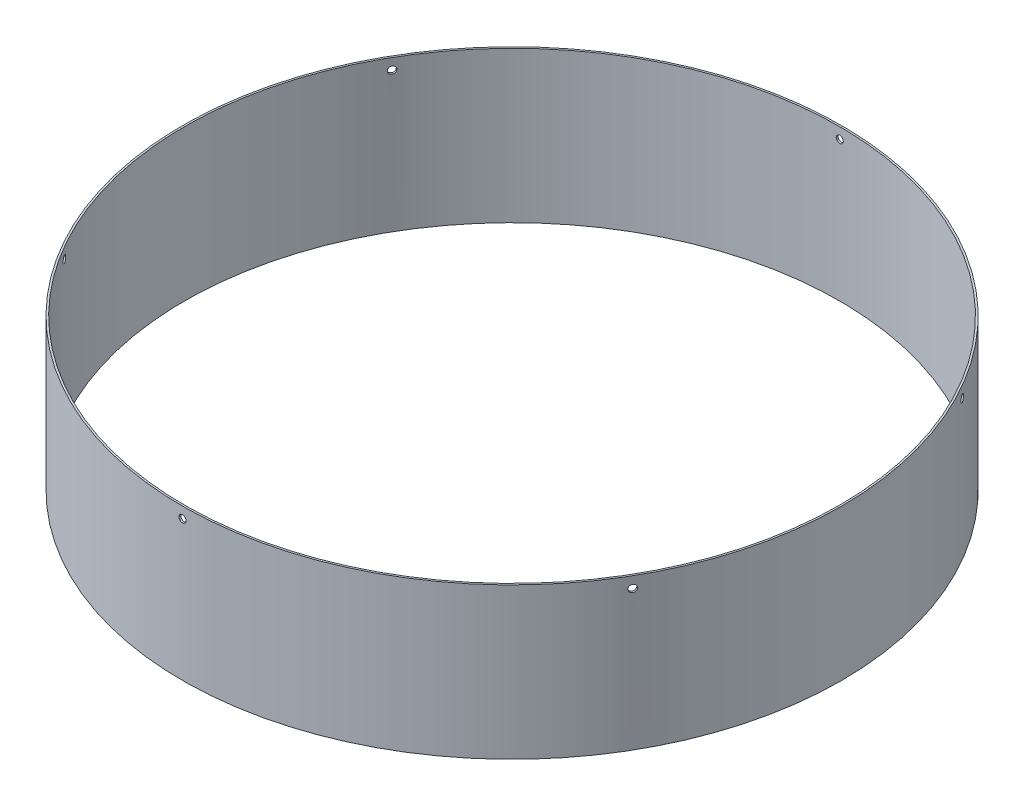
ISO-10303-21;
HEADER;
FILE_DESCRIPTION(('STEP AP214'),'2;1');
FILE_NAME('part.step','',(''),(''),'','','');
FILE_SCHEMA(('AUTOMOTIVE_DESIGN { 1 0 10303 214 1 1 1 1 }'));
ENDSEC;
DATA;
#1=APPLICATION_CONTEXT('core data for automotive mechanical design processes');
#2=APPLICATION_PROTOCOL_DEFINITION('international standard','automotive_design',2000,#1);
#3=PRODUCT_CONTEXT('',#1,'mechanical');
#4=PRODUCT('Part','Part','',(#3));
#5=PRODUCT_RELATED_PRODUCT_CATEGORY('part','',(#4));
#6=PRODUCT_DEFINITION_FORMATION('','',#4);
#7=PRODUCT_DEFINITION_CONTEXT('part definition',#1,'design');
#8=PRODUCT_DEFINITION('design','',#6,#7);
#9=PRODUCT_DEFINITION_SHAPE('','',#8);
#10=(LENGTH_UNIT() NAMED_UNIT(*) SI_UNIT(.MILLI.,.METRE.));
#11=(NAMED_UNIT(*) PLANE_ANGLE_UNIT() SI_UNIT($,.RADIAN.));
#12=(NAMED_UNIT(*) SI_UNIT($,.STERADIAN.) SOLID_ANGLE_UNIT());
#13=UNCERTAINTY_MEASURE_WITH_UNIT(LENGTH_MEASURE(1.E-05),#10,'distance_accuracy_value','');
#14=(GEOMETRIC_REPRESENTATION_CONTEXT(3) GLOBAL_UNCERTAINTY_ASSIGNED_CONTEXT((#13)) GLOBAL_UNIT_ASSIGNED_CONTEXT((#10,
#11,#12)) REPRESENTATION_CONTEXT('',''));
#15=CARTESIAN_POINT('',(0.,0.,0.));
#16=DIRECTION('',(0.,0.,1.));
#17=DIRECTION('',(1.,0.,0.));
#18=AXIS2_PLACEMENT_3D('',#15,#16,#17);
#19=CARTESIAN_POINT('',(0.,69.85,0.));
#20=DIRECTION('',(0.,1.,0.));
#21=DIRECTION('',(0.,0.,1.));
#22=AXIS2_PLACEMENT_3D('',#19,#20,#21);
#23=PLANE('',#22);
#24=DIRECTION('',(-1.,0.,0.));
#25=VECTOR('',#24,1.);
#26=CARTESIAN_POINT('',(0.,69.85,0.));
#27=LINE('',#26,#25);
#28=CARTESIAN_POINT('',(152.4127,69.85,0.));
#29=VERTEX_POINT('',#28);
#30=CARTESIAN_POINT('',(151.5491,69.85,0.));
#31=VERTEX_POINT('',#30);
#32=EDGE_CURVE('E69',#29,#31,#27,.T.);
#33=ORIENTED_EDGE('',*,*,#32,.F.);
#34=CARTESIAN_POINT('',(0.,69.85,0.));
#35=DIRECTION('',(0.,1.,0.));
#36=DIRECTION('',(0.,0.,1.));
#37=AXIS2_PLACEMENT_3D('',#34,#35,#36);
#38=CIRCLE('',#37,152.4127);
#39=CARTESIAN_POINT('',(152.412699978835,69.85,0.00253999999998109));
#40=VERTEX_POINT('',#39);
#41=EDGE_CURVE('E104',#29,#40,#38,.T.);
#42=ORIENTED_EDGE('',*,*,#41,.T.);
#43=DIRECTION('',(1.,0.,0.));
#44=VECTOR('',#43,1.);
#45=CARTESIAN_POINT('',(0.,69.85,0.00253999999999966));
#46=LINE('',#45,#44);
#47=CARTESIAN_POINT('',(151.549099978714,69.85,0.0025399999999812));
#48=VERTEX_POINT('',#47);
#49=EDGE_CURVE('E98',#48,#40,#46,.T.);
#50=ORIENTED_EDGE('',*,*,#49,.F.);
#51=CARTESIAN_POINT('',(0.,69.85,0.));
#52=DIRECTION('',(0.,1.,0.));
#53=DIRECTION('',(0.,0.,1.));
#54=AXIS2_PLACEMENT_3D('',#51,#52,#53);
#55=CIRCLE('',#54,151.5491);
#56=EDGE_CURVE('E108',#31,#48,#55,.T.);
#57=ORIENTED_EDGE('',*,*,#56,.F.);
#58=EDGE_LOOP('',(#33,#42,#50,#57));
#59=FACE_BOUND('',#58,.T.);
#60=ADVANCED_FACE('F46',(#59),#23,.T.);
#61=CARTESIAN_POINT('',(0.,0.,0.));
#62=DIRECTION('',(0.,1.,0.));
#63=DIRECTION('',(0.,0.,1.));
#64=AXIS2_PLACEMENT_3D('',#61,#62,#63);
#65=PLANE('',#64);
#66=CARTESIAN_POINT('',(0.,0.,0.));
#67=DIRECTION('',(0.,1.,0.));
#68=DIRECTION('',(0.,0.,1.));
#69=AXIS2_PLACEMENT_3D('',#66,#67,#68);
#70=CIRCLE('',#69,152.4127);
#71=CARTESIAN_POINT('',(152.4127,0.,0.));
#72=VERTEX_POINT('',#71);
#73=CARTESIAN_POINT('',(152.412699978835,0.,0.00253999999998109));
#74=VERTEX_POINT('',#73);
#75=EDGE_CURVE('E113',#72,#74,#70,.T.);
#76=ORIENTED_EDGE('',*,*,#75,.F.);
#77=DIRECTION('',(-1.,0.,0.));
#78=VECTOR('',#77,1.);
#79=CARTESIAN_POINT('',(0.,0.,0.));
#80=LINE('',#79,#78);
#81=CARTESIAN_POINT('',(151.5491,0.,0.));
#82=VERTEX_POINT('',#81);
#83=EDGE_CURVE('E177',#72,#82,#80,.T.);
#84=ORIENTED_EDGE('',*,*,#83,.T.);
#85=CARTESIAN_POINT('',(0.,0.,0.));
#86=DIRECTION('',(0.,1.,0.));
#87=DIRECTION('',(0.,0.,1.));
#88=AXIS2_PLACEMENT_3D('',#85,#86,#87);
#89=CIRCLE('',#88,151.5491);
#90=CARTESIAN_POINT('',(151.549099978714,0.,0.0025399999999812));
#91=VERTEX_POINT('',#90);
#92=EDGE_CURVE('E114',#82,#91,#89,.T.);
#93=ORIENTED_EDGE('',*,*,#92,.T.);
#94=DIRECTION('',(1.,0.,0.));
#95=VECTOR('',#94,1.);
#96=CARTESIAN_POINT('',(0.,0.,0.00253999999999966));
#97=LINE('',#96,#95);
#98=EDGE_CURVE('E62',#91,#74,#97,.T.);
#99=ORIENTED_EDGE('',*,*,#98,.T.);
#100=EDGE_LOOP('',(#76,#84,#93,#99));
#101=FACE_BOUND('',#100,.T.);
#102=ADVANCED_FACE('F171',(#101),#65,.F.);
#103=CARTESIAN_POINT('',(0.,69.85,0.));
#104=DIRECTION('',(0.,-1.,0.));
#105=DIRECTION('',(0.,0.,-1.));
#106=AXIS2_PLACEMENT_3D('',#103,#104,#105);
#107=CYLINDRICAL_SURFACE('',#106,152.4127);
#108=CARTESIAN_POINT('',(132.801678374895,64.77,-74.7886712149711));
#109=CARTESIAN_POINT('',(132.801676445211,64.8616645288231,-74.7886747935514));
#110=CARTESIAN_POINT('',(132.797876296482,64.9533954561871,-74.7954237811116));
#111=CARTESIAN_POINT('',(132.782763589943,65.1343307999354,-74.8222496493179));
#112=CARTESIAN_POINT('',(132.771441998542,65.2235320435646,-74.8423425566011));
#113=CARTESIAN_POINT('',(132.74159107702,65.3967605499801,-74.8952738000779));
#114=CARTESIAN_POINT('',(132.723065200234,65.4807902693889,-74.9281060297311));
#115=CARTESIAN_POINT('',(132.679309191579,65.6413048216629,-75.0055598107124));
#116=CARTESIAN_POINT('',(132.654080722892,65.717791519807,-75.0501784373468));
#117=CARTESIAN_POINT('',(132.597595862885,65.8610867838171,-75.1499299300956));
#118=CARTESIAN_POINT('',(132.566338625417,65.9278939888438,-75.2050642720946));
#119=CARTESIAN_POINT('',(132.498647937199,66.0499228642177,-75.3242597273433));
#120=CARTESIAN_POINT('',(132.462214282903,66.1051440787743,-75.3883211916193));
#121=CARTESIAN_POINT('',(132.385170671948,66.2024306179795,-75.5235311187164));
#122=CARTESIAN_POINT('',(132.344560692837,66.2444958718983,-75.5946796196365));
#123=CARTESIAN_POINT('',(132.260287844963,66.3142756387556,-75.7420264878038));
#124=CARTESIAN_POINT('',(132.216624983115,66.3419901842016,-75.8182248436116));
#125=CARTESIAN_POINT('',(132.127466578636,66.3822809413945,-75.9734934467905));
#126=CARTESIAN_POINT('',(132.081971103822,66.3948577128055,-76.0525635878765));
#127=CARTESIAN_POINT('',(131.990427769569,66.4045176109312,-76.2113278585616));
#128=CARTESIAN_POINT('',(131.94437991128,66.4016007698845,-76.2910219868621));
#129=CARTESIAN_POINT('',(131.853043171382,66.3803567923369,-76.4487700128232));
#130=CARTESIAN_POINT('',(131.807754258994,66.3620302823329,-76.5268239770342));
#131=CARTESIAN_POINT('',(131.719233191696,66.3104881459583,-76.6790876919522));
#132=CARTESIAN_POINT('',(131.676001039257,66.2772725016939,-76.7532974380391));
#133=CARTESIAN_POINT('',(131.592844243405,66.1968942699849,-76.8957819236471));
#134=CARTESIAN_POINT('',(131.552919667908,66.1497313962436,-76.9640565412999));
#135=CARTESIAN_POINT('',(131.477544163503,66.0427977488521,-77.0927498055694));
#136=CARTESIAN_POINT('',(131.442093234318,65.983026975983,-77.1531684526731));
#137=CARTESIAN_POINT('',(131.376705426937,65.8525706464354,-77.2644586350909));
#138=CARTESIAN_POINT('',(131.346768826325,65.7818845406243,-77.3153296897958));
#139=CARTESIAN_POINT('',(131.293297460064,65.6316060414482,-77.4060976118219));
#140=CARTESIAN_POINT('',(131.269762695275,65.5520136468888,-77.4459944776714));
#141=CARTESIAN_POINT('',(131.229794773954,65.3861816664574,-77.5136996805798));
#142=CARTESIAN_POINT('',(131.213361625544,65.2999420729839,-77.5415080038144));
#143=CARTESIAN_POINT('',(131.188087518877,65.1232639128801,-77.5842602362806));
#144=CARTESIAN_POINT('',(131.179246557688,65.0328253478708,-77.5992041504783));
#145=CARTESIAN_POINT('',(131.169421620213,64.850321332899,-77.6158105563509));
#146=CARTESIAN_POINT('',(131.168437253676,64.7582559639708,-77.6174737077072));
#147=CARTESIAN_POINT('',(131.174353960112,64.5751075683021,-77.60747397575));
#148=CARTESIAN_POINT('',(131.181255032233,64.4840245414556,-77.5958110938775));
#149=CARTESIAN_POINT('',(131.202735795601,64.3054285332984,-77.5594847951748));
#150=CARTESIAN_POINT('',(131.217315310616,64.2179154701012,-77.5348216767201));
#151=CARTESIAN_POINT('',(131.253717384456,64.048941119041,-77.4731828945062));
#152=CARTESIAN_POINT('',(131.275539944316,63.9674798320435,-77.4362072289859));
#153=CARTESIAN_POINT('',(131.325779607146,63.8129179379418,-77.3509739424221));
#154=CARTESIAN_POINT('',(131.354196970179,63.7398176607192,-77.3027158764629));
#155=CARTESIAN_POINT('',(131.416784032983,63.6040561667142,-77.196268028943));
#156=CARTESIAN_POINT('',(131.450953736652,63.5413949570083,-77.1380782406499));
#157=CARTESIAN_POINT('',(131.524040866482,63.4282878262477,-77.013394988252));
#158=CARTESIAN_POINT('',(131.562958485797,63.3778424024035,-76.9469011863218));
#159=CARTESIAN_POINT('',(131.644402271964,63.290602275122,-76.8074799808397));
#160=CARTESIAN_POINT('',(131.686928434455,63.2538075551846,-76.7345525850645));
#161=CARTESIAN_POINT('',(131.774354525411,63.1949141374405,-76.5843205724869));
#162=CARTESIAN_POINT('',(131.819254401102,63.1728151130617,-76.5070160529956));
#163=CARTESIAN_POINT('',(131.910137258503,63.1439393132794,-76.3502129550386));
#164=CARTESIAN_POINT('',(131.956120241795,63.137162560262,-76.2707143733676));
#165=CARTESIAN_POINT('',(132.047856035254,63.1391237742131,-76.1117813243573));
#166=CARTESIAN_POINT('',(132.093608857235,63.1478609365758,-76.0323468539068));
#167=CARTESIAN_POINT('',(132.183594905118,63.1806003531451,-75.8757966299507));
#168=CARTESIAN_POINT('',(132.227828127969,63.2046026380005,-75.7986808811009));
#169=CARTESIAN_POINT('',(132.313538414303,63.2671913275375,-75.6489664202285));
#170=CARTESIAN_POINT('',(132.355015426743,63.305778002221,-75.5763677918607));
#171=CARTESIAN_POINT('',(132.434061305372,63.3964384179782,-75.4377683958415));
#172=CARTESIAN_POINT('',(132.471630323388,63.4485116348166,-75.3717673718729));
#173=CARTESIAN_POINT('',(132.541827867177,63.5646638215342,-75.2482560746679));
#174=CARTESIAN_POINT('',(132.574456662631,63.6287421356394,-75.1907453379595));
#175=CARTESIAN_POINT('',(132.63389429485,63.7671085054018,-75.0858498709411));
#176=CARTESIAN_POINT('',(132.660701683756,63.8413990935,-75.0384676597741));
#177=CARTESIAN_POINT('',(132.707770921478,63.9980961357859,-74.9551929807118));
#178=CARTESIAN_POINT('',(132.728029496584,64.0805066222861,-74.9193062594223));
#179=CARTESIAN_POINT('',(132.761418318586,64.2510120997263,-74.8601235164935));
#180=CARTESIAN_POINT('',(132.774557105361,64.3391001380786,-74.8368124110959));
#181=CARTESIAN_POINT('',(132.789854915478,64.4847907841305,-74.8096630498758));
#182=CARTESIAN_POINT('',(132.794283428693,64.5414468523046,-74.8018010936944));
#183=CARTESIAN_POINT('',(132.800195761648,64.655393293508,-74.7913040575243));
#184=CARTESIAN_POINT('',(132.801679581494,64.712683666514,-74.7886689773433));
#185=CARTESIAN_POINT('',(132.801678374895,64.77,-74.7886712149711));
#186=B_SPLINE_CURVE_WITH_KNOTS('',3,(#108,#109,#110,#111,#112,#113,#114,#115,#116,#117,#118,
#119,#120,#121,#122,#123,#124,#125,#126,#127,#128,#129,#130,#131,#132,#133,#134,#135,#136,#137,
#138,#139,#140,#141,#142,#143,#144,#145,#146,#147,#148,#149,#150,#151,#152,#153,#154,#155,#156,
#157,#158,#159,#160,#161,#162,#163,#164,#165,#166,#167,#168,#169,#170,#171,#172,#173,#174,#175,
#176,#177,#178,#179,#180,#181,#182,#183,#184,#185),.UNSPECIFIED.,.T.,.F.,(4,2,2,2,2,2,2,2,2,2,2,
2,2,2,2,2,2,2,2,2,2,2,2,2,2,2,2,2,2,2,2,2,2,2,2,2,2,2,4),(0.,0.274784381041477,
0.549899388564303,0.824882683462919,1.09979780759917,1.37475154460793,1.64971609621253,
1.92468212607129,2.19964753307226,2.47460277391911,2.74955744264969,3.02450093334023,
3.29944475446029,3.5743942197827,3.849343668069,4.12430695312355,4.39927027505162,
4.67423391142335,4.94919744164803,5.22414731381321,5.49909715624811,5.77404068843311,
6.0489842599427,6.3239386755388,6.5988932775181,6.8738590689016,7.14882452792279,
7.42378387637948,7.69874362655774,7.97368911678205,8.24863515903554,8.5235862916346,
8.79852673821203,9.07345217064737,9.34844590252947,9.62357689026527,9.89837713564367,
10.0701953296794,10.2420135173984),.UNSPECIFIED.);
#187=CARTESIAN_POINT('',(132.801678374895,64.77,-74.7886712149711));
#188=VERTEX_POINT('',#187);
#189=EDGE_CURVE('E131',#188,#188,#186,.T.);
#190=ORIENTED_EDGE('',*,*,#189,.T.);
#191=EDGE_LOOP('',(#190));
#192=FACE_BOUND('',#191,.T.);
#193=CARTESIAN_POINT('',(-132.801678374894,64.77,-74.788671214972));
#194=CARTESIAN_POINT('',(-132.80167644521,64.6783354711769,-74.7886747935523));
#195=CARTESIAN_POINT('',(-132.797876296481,64.5866045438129,-74.7954237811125));
#196=CARTESIAN_POINT('',(-132.782763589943,64.4056692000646,-74.8222496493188));
#197=CARTESIAN_POINT('',(-132.771441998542,64.3164679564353,-74.842342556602));
#198=CARTESIAN_POINT('',(-132.74159107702,64.1432394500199,-74.8952738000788));
#199=CARTESIAN_POINT('',(-132.723065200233,64.059209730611,-74.928106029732));
#200=CARTESIAN_POINT('',(-132.679309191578,63.8986951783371,-75.0055598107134));
#201=CARTESIAN_POINT('',(-132.654080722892,63.822208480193,-75.0501784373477));
#202=CARTESIAN_POINT('',(-132.597595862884,63.6789132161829,-75.1499299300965));
#203=CARTESIAN_POINT('',(-132.566338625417,63.6121060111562,-75.2050642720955));
#204=CARTESIAN_POINT('',(-132.498647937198,63.4900771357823,-75.3242597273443));
#205=CARTESIAN_POINT('',(-132.462214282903,63.4348559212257,-75.3883211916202));
#206=CARTESIAN_POINT('',(-132.385170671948,63.3375693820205,-75.5235311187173));
#207=CARTESIAN_POINT('',(-132.344560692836,63.2955041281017,-75.5946796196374));
#208=CARTESIAN_POINT('',(-132.260287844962,63.2257243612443,-75.7420264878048));
#209=CARTESIAN_POINT('',(-132.216624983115,63.1980098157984,-75.8182248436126));
#210=CARTESIAN_POINT('',(-132.127466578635,63.1577190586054,-75.9734934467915));
#211=CARTESIAN_POINT('',(-132.081971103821,63.1451422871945,-76.0525635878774));
#212=CARTESIAN_POINT('',(-131.990427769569,63.1354823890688,-76.2113278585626));
#213=CARTESIAN_POINT('',(-131.944379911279,63.1383992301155,-76.291021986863));
#214=CARTESIAN_POINT('',(-131.853043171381,63.1596432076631,-76.4487700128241));
#215=CARTESIAN_POINT('',(-131.807754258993,63.1779697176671,-76.5268239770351));
#216=CARTESIAN_POINT('',(-131.719233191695,63.2295118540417,-76.6790876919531));
#217=CARTESIAN_POINT('',(-131.676001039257,63.2627274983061,-76.75329743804));
#218=CARTESIAN_POINT('',(-131.592844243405,63.343105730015,-76.895781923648));
#219=CARTESIAN_POINT('',(-131.552919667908,63.3902686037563,-76.9640565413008));
#220=CARTESIAN_POINT('',(-131.477544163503,63.4972022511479,-77.0927498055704));
#221=CARTESIAN_POINT('',(-131.442093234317,63.556973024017,-77.153168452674));
#222=CARTESIAN_POINT('',(-131.376705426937,63.6874293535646,-77.2644586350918));
#223=CARTESIAN_POINT('',(-131.346768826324,63.7581154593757,-77.3153296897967));
#224=CARTESIAN_POINT('',(-131.293297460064,63.9083939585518,-77.4060976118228));
#225=CARTESIAN_POINT('',(-131.269762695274,63.9879863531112,-77.4459944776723));
#226=CARTESIAN_POINT('',(-131.229794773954,64.1538183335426,-77.5136996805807));
#227=CARTESIAN_POINT('',(-131.213361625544,64.2400579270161,-77.5415080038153));
#228=CARTESIAN_POINT('',(-131.188087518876,64.4167360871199,-77.5842602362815));
#229=CARTESIAN_POINT('',(-131.179246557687,64.5071746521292,-77.5992041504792));
#230=CARTESIAN_POINT('',(-131.169421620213,64.689678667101,-77.6158105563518));
#231=CARTESIAN_POINT('',(-131.168437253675,64.7817440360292,-77.6174737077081));
#232=CARTESIAN_POINT('',(-131.174353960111,64.9648924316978,-77.6074739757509));
#233=CARTESIAN_POINT('',(-131.181255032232,65.0559754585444,-77.5958110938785));
#234=CARTESIAN_POINT('',(-131.202735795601,65.2345714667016,-77.5594847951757));
#235=CARTESIAN_POINT('',(-131.217315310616,65.3220845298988,-77.534821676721));
#236=CARTESIAN_POINT('',(-131.253717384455,65.491058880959,-77.4731828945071));
#237=CARTESIAN_POINT('',(-131.275539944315,65.5725201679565,-77.4362072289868));
#238=CARTESIAN_POINT('',(-131.325779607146,65.7270820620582,-77.350973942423));
#239=CARTESIAN_POINT('',(-131.354196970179,65.8001823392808,-77.3027158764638));
#240=CARTESIAN_POINT('',(-131.416784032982,65.9359438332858,-77.1962680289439));
#241=CARTESIAN_POINT('',(-131.450953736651,65.9986050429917,-77.1380782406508));
#242=CARTESIAN_POINT('',(-131.524040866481,66.1117121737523,-77.013394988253));
#243=CARTESIAN_POINT('',(-131.562958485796,66.1621575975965,-76.9469011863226));
#244=CARTESIAN_POINT('',(-131.644402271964,66.249397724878,-76.8074799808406));
#245=CARTESIAN_POINT('',(-131.686928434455,66.2861924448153,-76.7345525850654));
#246=CARTESIAN_POINT('',(-131.774354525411,66.3450858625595,-76.5843205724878));
#247=CARTESIAN_POINT('',(-131.819254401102,66.3671848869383,-76.5070160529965));
#248=CARTESIAN_POINT('',(-131.910137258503,66.3960606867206,-76.3502129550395));
#249=CARTESIAN_POINT('',(-131.956120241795,66.402837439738,-76.2707143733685));
#250=CARTESIAN_POINT('',(-132.047856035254,66.4008762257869,-76.1117813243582));
#251=CARTESIAN_POINT('',(-132.093608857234,66.3921390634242,-76.0323468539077));
#252=CARTESIAN_POINT('',(-132.183594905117,66.3593996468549,-75.8757966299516));
#253=CARTESIAN_POINT('',(-132.227828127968,66.3353973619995,-75.7986808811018));
#254=CARTESIAN_POINT('',(-132.313538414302,66.2728086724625,-75.6489664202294));
#255=CARTESIAN_POINT('',(-132.355015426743,66.234221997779,-75.5763677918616));
#256=CARTESIAN_POINT('',(-132.434061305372,66.1435615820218,-75.4377683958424));
#257=CARTESIAN_POINT('',(-132.471630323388,66.0914883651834,-75.3717673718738));
#258=CARTESIAN_POINT('',(-132.541827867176,65.9753361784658,-75.2482560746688));
#259=CARTESIAN_POINT('',(-132.57445666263,65.9112578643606,-75.1907453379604));
#260=CARTESIAN_POINT('',(-132.63389429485,65.7728914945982,-75.085849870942));
#261=CARTESIAN_POINT('',(-132.660701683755,65.6986009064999,-75.038467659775));
#262=CARTESIAN_POINT('',(-132.707770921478,65.541903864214,-74.9551929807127));
#263=CARTESIAN_POINT('',(-132.728029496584,65.4594933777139,-74.9193062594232));
#264=CARTESIAN_POINT('',(-132.761418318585,65.2889879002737,-74.8601235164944));
#265=CARTESIAN_POINT('',(-132.774557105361,65.2008998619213,-74.8368124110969));
#266=CARTESIAN_POINT('',(-132.789854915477,65.0552092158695,-74.8096630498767));
#267=CARTESIAN_POINT('',(-132.794283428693,64.9985531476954,-74.8018010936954));
#268=CARTESIAN_POINT('',(-132.800195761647,64.884606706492,-74.7913040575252));
#269=CARTESIAN_POINT('',(-132.801679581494,64.8273163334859,-74.7886689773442));
#270=CARTESIAN_POINT('',(-132.801678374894,64.77,-74.788671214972));
#271=B_SPLINE_CURVE_WITH_KNOTS('',3,(#193,#194,#195,#196,#197,#198,#199,#200,#201,#202,#203,
#204,#205,#206,#207,#208,#209,#210,#211,#212,#213,#214,#215,#216,#217,#218,#219,#220,#221,#222,
#223,#224,#225,#226,#227,#228,#229,#230,#231,#232,#233,#234,#235,#236,#237,#238,#239,#240,#241,
#242,#243,#244,#245,#246,#247,#248,#249,#250,#251,#252,#253,#254,#255,#256,#257,#258,#259,#260,
#261,#262,#263,#264,#265,#266,#267,#268,#269,#270),.UNSPECIFIED.,.T.,.F.,(4,2,2,2,2,2,2,2,2,2,2,
2,2,2,2,2,2,2,2,2,2,2,2,2,2,2,2,2,2,2,2,2,2,2,2,2,2,2,4),(0.,0.274784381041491,
0.549899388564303,0.824882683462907,1.09979780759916,1.37475154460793,1.64971609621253,
1.9246821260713,2.1996475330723,2.47460277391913,2.74955744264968,3.02450093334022,
3.29944475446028,3.57439421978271,3.84934366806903,4.12430695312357,4.39927027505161,
4.67423391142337,4.94919744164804,5.22414731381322,5.49909715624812,5.77404068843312,
6.04898425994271,6.32393867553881,6.59889327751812,6.87385906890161,7.1488245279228,
7.42378387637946,7.69874362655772,7.97368911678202,8.24863515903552,8.52358629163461,
8.79852673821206,9.07345217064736,9.34844590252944,9.62357689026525,9.89837713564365,
10.0701953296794,10.2420135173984),.UNSPECIFIED.);
#272=CARTESIAN_POINT('',(-132.801678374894,64.77,-74.788671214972));
#273=VERTEX_POINT('',#272);
#274=EDGE_CURVE('E236',#273,#273,#271,.T.);
#275=ORIENTED_EDGE('',*,*,#274,.T.);
#276=EDGE_LOOP('',(#275));
#277=FACE_BOUND('',#276,.T.);
#278=CARTESIAN_POINT('',(131.169728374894,64.77,77.615291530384));
#279=CARTESIAN_POINT('',(131.169730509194,64.8616645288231,77.6152880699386));
#280=CARTESIAN_POINT('',(131.173675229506,64.9533954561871,77.6086225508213));
#281=CARTESIAN_POINT('',(131.189350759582,65.1343307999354,77.5821216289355));
#282=CARTESIAN_POINT('',(131.201090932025,65.2235320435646,77.5622703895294));
#283=CARTESIAN_POINT('',(131.232005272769,65.3967605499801,77.5099531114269));
#284=CARTESIAN_POINT('',(131.251175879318,65.4807902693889,77.4774931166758));
#285=CARTESIAN_POINT('',(131.296374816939,65.6413048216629,77.4008724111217));
#286=CARTESIAN_POINT('',(131.322401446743,65.717791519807,77.3567146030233));
#287=CARTESIAN_POINT('',(131.380546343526,65.8610867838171,77.2579215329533));
#288=CARTESIAN_POINT('',(131.412665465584,65.9278939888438,77.2032848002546));
#289=CARTESIAN_POINT('',(131.482046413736,66.0499228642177,77.0850652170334));
#290=CARTESIAN_POINT('',(131.519308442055,66.1051440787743,77.0214820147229));
#291=CARTESIAN_POINT('',(131.597881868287,66.2024306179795,76.8871553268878));
#292=CARTESIAN_POINT('',(131.639193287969,66.2444958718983,76.8164118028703));
#293=CARTESIAN_POINT('',(131.724662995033,66.3142756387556,76.6697559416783));
#294=CARTESIAN_POINT('',(131.768821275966,66.3419901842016,76.5938436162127));
#295=CARTESIAN_POINT('',(131.858708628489,66.3822809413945,76.438995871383));
#296=CARTESIAN_POINT('',(131.904437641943,66.3948577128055,76.360060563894));
#297=CARTESIAN_POINT('',(131.996159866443,66.4045176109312,76.2013995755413));
#298=CARTESIAN_POINT('',(132.042153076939,66.4016007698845,76.1216738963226));
#299=CARTESIAN_POINT('',(132.13309850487,66.3803567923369,75.9636999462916));
#300=CARTESIAN_POINT('',(132.178050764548,66.3620302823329,75.8854516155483));
#301=CARTESIAN_POINT('',(132.265654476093,66.3104881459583,75.732658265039));
#302=CARTESIAN_POINT('',(132.308305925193,66.2772725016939,75.6581132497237));
#303=CARTESIAN_POINT('',(132.390122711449,66.1968942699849,75.5148551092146));
#304=CARTESIAN_POINT('',(132.429287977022,66.1497313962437,75.4461421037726));
#305=CARTESIAN_POINT('',(132.503051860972,66.0427977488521,75.3165183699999));
#306=CARTESIAN_POINT('',(132.537650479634,65.983026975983,75.2556076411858));
#307=CARTESIAN_POINT('',(132.601336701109,65.8525706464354,75.1433350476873));
#308=CARTESIAN_POINT('',(132.630424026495,65.7818845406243,75.0919736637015));
#309=CARTESIAN_POINT('',(132.682295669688,65.6316060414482,75.000282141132));
#310=CARTESIAN_POINT('',(132.70507998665,65.5520136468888,74.9599520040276));
#311=CARTESIAN_POINT('',(132.743730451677,65.3861816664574,74.8914861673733));
#312=CARTESIAN_POINT('',(132.75959659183,65.2999420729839,74.8633504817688));
#313=CARTESIAN_POINT('',(132.78398405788,65.1232639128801,74.8200863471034));
#314=CARTESIAN_POINT('',(132.792505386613,65.0328253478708,74.8049578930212));
#315=CARTESIAN_POINT('',(132.801974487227,64.850321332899,74.7881460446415));
#316=CARTESIAN_POINT('',(132.802922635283,64.7582559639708,74.786461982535));
#317=CARTESIAN_POINT('',(132.797220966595,64.5751075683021,74.7965858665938));
#318=CARTESIAN_POINT('',(132.790571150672,64.4840245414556,74.8083938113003));
#319=CARTESIAN_POINT('',(132.769852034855,64.3054285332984,74.8451598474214));
#320=CARTESIAN_POINT('',(132.755782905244,64.2179154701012,74.8701176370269));
#321=CARTESIAN_POINT('',(132.720603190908,64.048941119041,74.932462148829));
#322=CARTESIAN_POINT('',(132.699492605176,63.9674798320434,74.9698488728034));
#323=CARTESIAN_POINT('',(132.650798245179,63.8129179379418,75.0559743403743));
#324=CARTESIAN_POINT('',(132.623214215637,63.7398176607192,75.1047135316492));
#325=CARTESIAN_POINT('',(132.562321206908,63.6040561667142,75.212139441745));
#326=CARTESIAN_POINT('',(132.52901222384,63.5413949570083,75.270826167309));
#327=CARTESIAN_POINT('',(132.457576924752,63.4282878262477,75.3964631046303));
#328=CARTESIAN_POINT('',(132.419450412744,63.3778424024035,75.4634136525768));
#329=CARTESIAN_POINT('',(132.339430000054,63.290602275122,75.6036566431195));
#330=CARTESIAN_POINT('',(132.297536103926,63.2538075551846,75.6769490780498));
#331=CARTESIAN_POINT('',(132.21114441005,63.1949141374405,75.8277783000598));
#332=CARTESIAN_POINT('',(132.166646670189,63.1728151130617,75.9053149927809));
#333=CARTESIAN_POINT('',(132.076292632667,63.1439393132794,76.062423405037));
#334=CARTESIAN_POINT('',(132.030436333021,63.137162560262,76.1419951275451));
#335=CARTESIAN_POINT('',(131.938664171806,63.1391237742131,76.3009071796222));
#336=CARTESIAN_POINT('',(131.89274831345,63.1478609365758,76.3802475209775));
#337=CARTESIAN_POINT('',(131.802164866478,63.1806003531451,76.5364528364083));
#338=CARTESIAN_POINT('',(131.757497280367,63.2046026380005,76.6133178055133));
#339=CARTESIAN_POINT('',(131.670695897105,63.2671913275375,76.7624023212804));
#340=CARTESIAN_POINT('',(131.628562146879,63.305778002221,76.8346217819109));
#341=CARTESIAN_POINT('',(131.548054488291,63.3964384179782,76.9723772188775));
#342=CARTESIAN_POINT('',(131.509680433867,63.4485116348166,77.0379134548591));
#343=CARTESIAN_POINT('',(131.437815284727,63.5646638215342,77.1604619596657));
#344=CARTESIAN_POINT('',(131.404323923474,63.6287421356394,77.217474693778));
#345=CARTESIAN_POINT('',(131.343200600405,63.7671085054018,77.3213969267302));
#346=CARTESIAN_POINT('',(131.315570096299,63.8413990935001,77.3683039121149));
#347=CARTESIAN_POINT('',(131.266986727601,63.998096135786,77.4507044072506));
#348=CARTESIAN_POINT('',(131.246037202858,64.0805066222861,77.4861922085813));
#349=CARTESIAN_POINT('',(131.211477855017,64.2510120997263,77.5446991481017));
#350=CARTESIAN_POINT('',(131.19785923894,64.3391001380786,77.567733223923));
#351=CARTESIAN_POINT('',(131.181996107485,64.4847907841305,77.594556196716));
#352=CARTESIAN_POINT('',(131.177401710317,64.5414468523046,77.6023223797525));
#353=CARTESIAN_POINT('',(131.171267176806,64.655393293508,77.6126911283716));
#354=CARTESIAN_POINT('',(131.169727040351,64.712683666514,77.6152936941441));
#355=CARTESIAN_POINT('',(131.169728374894,64.77,77.615291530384));
#356=B_SPLINE_CURVE_WITH_KNOTS('',3,(#278,#279,#280,#281,#282,#283,#284,#285,#286,#287,#288,
#289,#290,#291,#292,#293,#294,#295,#296,#297,#298,#299,#300,#301,#302,#303,#304,#305,#306,#307,
#308,#309,#310,#311,#312,#313,#314,#315,#316,#317,#318,#319,#320,#321,#322,#323,#324,#325,#326,
#327,#328,#329,#330,#331,#332,#333,#334,#335,#336,#337,#338,#339,#340,#341,#342,#343,#344,#345,
#346,#347,#348,#349,#350,#351,#352,#353,#354,#355),.UNSPECIFIED.,.T.,.F.,(4,2,2,2,2,2,2,2,2,2,2,
2,2,2,2,2,2,2,2,2,2,2,2,2,2,2,2,2,2,2,2,2,2,2,2,2,2,2,4),(0.,0.274784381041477,
0.549899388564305,0.824882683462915,1.09979780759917,1.37475154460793,1.64971609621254,
1.9246821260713,2.19964753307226,2.47460277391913,2.74955744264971,3.02450093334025,
3.2994447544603,3.5743942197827,3.84934366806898,4.12430695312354,4.39927027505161,
4.67423391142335,4.94919744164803,5.22414731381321,5.49909715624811,5.77404068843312,
6.04898425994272,6.32393867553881,6.59889327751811,6.87385906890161,7.14882452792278,
7.42378387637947,7.69874362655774,7.97368911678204,8.24863515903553,8.5235862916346,
8.79852673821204,9.07345217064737,9.34844590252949,9.62357689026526,9.89837713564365,
10.0701953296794,10.2420135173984),.UNSPECIFIED.);
#357=CARTESIAN_POINT('',(131.169728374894,64.77,77.615291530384));
#358=VERTEX_POINT('',#357);
#359=EDGE_CURVE('E192',#358,#358,#356,.T.);
#360=ORIENTED_EDGE('',*,*,#359,.T.);
#361=EDGE_LOOP('',(#360));
#362=FACE_BOUND('',#361,.T.);
#363=CARTESIAN_POINT('',(-9.96607360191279E-13,63.13805,152.4127));
#364=CARTESIAN_POINT('',(-0.0279190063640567,63.1380489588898,152.412700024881));
#365=CARTESIAN_POINT('',(-0.0558411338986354,63.1386614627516,152.412692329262));
#366=CARTESIAN_POINT('',(-0.111168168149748,63.1411529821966,152.412661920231));
#367=CARTESIAN_POINT('',(-0.138574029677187,63.1430110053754,152.412639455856));
#368=CARTESIAN_POINT('',(-0.19286940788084,63.1479928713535,152.412580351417));
#369=CARTESIAN_POINT('',(-0.219760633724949,63.1510978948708,152.412543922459));
#370=CARTESIAN_POINT('',(-0.273025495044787,63.1585710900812,152.412457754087));
#371=CARTESIAN_POINT('',(-0.299401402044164,63.1629230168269,152.412408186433));
#372=CARTESIAN_POINT('',(-0.351635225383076,63.1728873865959,152.412296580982));
#373=CARTESIAN_POINT('',(-0.377495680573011,63.1784864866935,152.412234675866));
#374=CARTESIAN_POINT('',(-0.428698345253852,63.1909421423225,152.412099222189));
#375=CARTESIAN_POINT('',(-0.454043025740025,63.1977885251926,152.412025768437));
#376=CARTESIAN_POINT('',(-0.504214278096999,63.212735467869,152.411868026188));
#377=CARTESIAN_POINT('',(-0.529042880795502,63.2208292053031,152.41178379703));
#378=CARTESIAN_POINT('',(-0.578182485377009,63.238267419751,152.411605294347));
#379=CARTESIAN_POINT('',(-0.602494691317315,63.2476085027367,152.411511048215));
#380=CARTESIAN_POINT('',(-0.650602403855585,63.2675379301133,152.411313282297));
#381=CARTESIAN_POINT('',(-0.674397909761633,63.2781262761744,152.411209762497));
#382=CARTESIAN_POINT('',(-0.721473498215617,63.300546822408,152.410994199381));
#383=CARTESIAN_POINT('',(-0.744752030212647,63.3123822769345,152.410882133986));
#384=CARTESIAN_POINT('',(-0.790795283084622,63.3372938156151,152.410650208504));
#385=CARTESIAN_POINT('',(-0.81355661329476,63.3503761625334,152.410530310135));
#386=CARTESIAN_POINT('',(-0.858567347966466,63.377778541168,152.410283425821));
#387=CARTESIAN_POINT('',(-0.880811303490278,63.3921075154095,152.410156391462));
#388=CARTESIAN_POINT('',(-0.924789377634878,63.42200056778,152.409895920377));
#389=CARTESIAN_POINT('',(-0.946515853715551,63.4375758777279,152.40976243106));
#390=CARTESIAN_POINT('',(-0.98946114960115,63.469959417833,152.409489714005));
#391=CARTESIAN_POINT('',(-1.0106700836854,63.4867807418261,152.409350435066));
#392=CARTESIAN_POINT('',(-1.05258258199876,63.5216546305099,152.409066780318));
#393=CARTESIAN_POINT('',(-1.07327405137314,63.5397217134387,152.40892235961));
#394=CARTESIAN_POINT('',(-1.11415355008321,63.5770856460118,152.408629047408));
#395=CARTESIAN_POINT('',(-1.1343273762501,63.5963980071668,152.408480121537));
#396=CARTESIAN_POINT('',(-1.17382657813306,63.635904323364,152.408181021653));
#397=CARTESIAN_POINT('',(-1.19315122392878,63.6560990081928,152.408030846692));
#398=CARTESIAN_POINT('',(-1.23053746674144,63.6970203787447,152.407733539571));
#399=CARTESIAN_POINT('',(-1.24861462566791,63.7177328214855,152.407586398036));
#400=CARTESIAN_POINT('',(-1.28350634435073,63.7596874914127,152.407296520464));
#401=CARTESIAN_POINT('',(-1.30033547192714,63.7809175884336,152.407153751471));
#402=CARTESIAN_POINT('',(-1.33273232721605,63.8239054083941,152.406873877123));
#403=CARTESIAN_POINT('',(-1.3483131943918,63.8456532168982,152.406736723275));
#404=CARTESIAN_POINT('',(-1.37821507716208,63.8896741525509,152.406469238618));
#405=CARTESIAN_POINT('',(-1.3925473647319,63.9119396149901,152.406338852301));
#406=CARTESIAN_POINT('',(-1.41995410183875,63.9569935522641,152.406085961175));
#407=CARTESIAN_POINT('',(-1.43303752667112,63.9797765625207,152.405963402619));
#408=CARTESIAN_POINT('',(-1.45794896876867,64.0258633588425,152.405727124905));
#409=CARTESIAN_POINT('',(-1.46978327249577,64.0491637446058,152.405613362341));
#410=CARTESIAN_POINT('',(-1.49219928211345,64.0962832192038,152.405395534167));
#411=CARTESIAN_POINT('',(-1.50278425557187,64.1201007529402,152.40529144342));
#412=CARTESIAN_POINT('',(-1.52270472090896,64.1682526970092,152.40509371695));
#413=CARTESIAN_POINT('',(-1.5320402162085,64.1925871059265,152.405000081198));
#414=CARTESIAN_POINT('',(-1.54946505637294,64.2417712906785,152.404823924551));
#415=CARTESIAN_POINT('',(-1.55755099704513,64.266622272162,152.404741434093));
#416=CARTESIAN_POINT('',(-1.5724801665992,64.3168384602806,152.404588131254));
#417=CARTESIAN_POINT('',(-1.57931655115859,64.3422057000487,152.404517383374));
#418=CARTESIAN_POINT('',(-1.59175004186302,64.3934536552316,152.404388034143));
#419=CARTESIAN_POINT('',(-1.59733694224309,64.4193368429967,152.404329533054));
#420=CARTESIAN_POINT('',(-1.60727477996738,64.4716163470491,152.404225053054));
#421=CARTESIAN_POINT('',(-1.61161233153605,64.4980152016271,152.404179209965));
#422=CARTESIAN_POINT('',(-1.61905457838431,64.5513260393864,152.4041003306));
#423=CARTESIAN_POINT('',(-1.6221429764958,64.5782402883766,152.404067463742));
#424=CARTESIAN_POINT('',(-1.62708970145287,64.6325823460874,152.404014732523));
#425=CARTESIAN_POINT('',(-1.62892915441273,64.6600118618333,152.403995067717));
#426=CARTESIAN_POINT('',(-1.63138051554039,64.7153847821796,152.403968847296));
#427=CARTESIAN_POINT('',(-1.6319713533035,64.7433291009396,152.403962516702));
#428=CARTESIAN_POINT('',(-1.63192767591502,64.7991884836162,152.403962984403));
#429=CARTESIAN_POINT('',(-1.63129440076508,64.8271035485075,152.403969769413));
#430=CARTESIAN_POINT('',(-1.62876113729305,64.8824174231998,152.403996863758));
#431=CARTESIAN_POINT('',(-1.62688214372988,64.9098171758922,152.404016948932));
#432=CARTESIAN_POINT('',(-1.62185943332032,64.964099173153,152.404070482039));
#433=CARTESIAN_POINT('',(-1.6187345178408,64.9909831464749,152.404103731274));
#434=CARTESIAN_POINT('',(-1.61122229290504,65.0442329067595,152.404183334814));
#435=CARTESIAN_POINT('',(-1.60685121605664,65.070600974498,152.404229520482));
#436=CARTESIAN_POINT('',(-1.59684938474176,65.1228183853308,152.40433464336));
#437=CARTESIAN_POINT('',(-1.591231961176,65.148670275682,152.404393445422));
#438=CARTESIAN_POINT('',(-1.57874046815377,65.1998551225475,152.404523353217));
#439=CARTESIAN_POINT('',(-1.57187656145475,65.2251905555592,152.404594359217));
#440=CARTESIAN_POINT('',(-1.55689537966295,65.2753426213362,152.404748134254));
#441=CARTESIAN_POINT('',(-1.54878491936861,65.3001612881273,152.40483083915));
#442=CARTESIAN_POINT('',(-1.53131405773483,65.349280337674,152.405007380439));
#443=CARTESIAN_POINT('',(-1.52195704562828,65.3735819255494,152.405101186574));
#444=CARTESIAN_POINT('',(-1.50199654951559,65.4216677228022,152.405299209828));
#445=CARTESIAN_POINT('',(-1.49139306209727,65.4454519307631,152.405403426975));
#446=CARTESIAN_POINT('',(-1.46894301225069,65.4925042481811,152.405621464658));
#447=CARTESIAN_POINT('',(-1.4570931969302,65.5157708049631,152.405735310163));
#448=CARTESIAN_POINT('',(-1.43215370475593,65.5617894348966,152.405971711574));
#449=CARTESIAN_POINT('',(-1.41905776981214,65.5845381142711,152.40609431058));
#450=CARTESIAN_POINT('',(-1.39162897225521,65.6295228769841,152.406347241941));
#451=CARTESIAN_POINT('',(-1.37728717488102,65.6517535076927,152.406477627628));
#452=CARTESIAN_POINT('',(-1.34736922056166,65.6957042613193,152.406745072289));
#453=CARTESIAN_POINT('',(-1.33178184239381,65.7174167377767,152.406882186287));
#454=CARTESIAN_POINT('',(-1.2993749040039,65.7603333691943,152.407161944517));
#455=CARTESIAN_POINT('',(-1.28254226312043,65.781527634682,152.407304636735));
#456=CARTESIAN_POINT('',(-1.24764644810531,65.8234101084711,152.407594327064));
#457=CARTESIAN_POINT('',(-1.229568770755,65.8440862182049,152.407741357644));
#458=CARTESIAN_POINT('',(-1.19218442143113,65.8849343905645,152.408038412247));
#459=CARTESIAN_POINT('',(-1.17286225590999,65.9050922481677,152.408188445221));
#460=CARTESIAN_POINT('',(-1.13337309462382,65.9445228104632,152.408487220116));
#461=CARTESIAN_POINT('',(-1.11320695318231,65.9637963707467,152.408635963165));
#462=CARTESIAN_POINT('',(-1.07234453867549,66.001085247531,152.408928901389));
#463=CARTESIAN_POINT('',(-1.05166239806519,66.0191160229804,152.409073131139));
#464=CARTESIAN_POINT('',(-1.00977026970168,66.0539198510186,152.409356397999));
#465=CARTESIAN_POINT('',(-0.988572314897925,66.0707073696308,152.409495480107));
#466=CARTESIAN_POINT('',(-0.945650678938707,66.1030258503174,152.409767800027));
#467=CARTESIAN_POINT('',(-0.923936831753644,66.1185698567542,152.40990108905));
#468=CARTESIAN_POINT('',(-0.879985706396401,66.1484028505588,152.410161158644));
#469=CARTESIAN_POINT('',(-0.857756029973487,66.1627030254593,152.41028799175));
#470=CARTESIAN_POINT('',(-0.812775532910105,66.1900503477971,152.410534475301));
#471=CARTESIAN_POINT('',(-0.790030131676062,66.2031064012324,152.410654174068));
#472=CARTESIAN_POINT('',(-0.744020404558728,66.2279678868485,152.410885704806));
#473=CARTESIAN_POINT('',(-0.720759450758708,66.2397795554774,152.410997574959));
#474=CARTESIAN_POINT('',(-0.673720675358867,66.2621550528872,152.411212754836));
#475=CARTESIAN_POINT('',(-0.649944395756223,66.2727221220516,152.41131608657));
#476=CARTESIAN_POINT('',(-0.60187678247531,66.2926115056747,152.411513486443));
#477=CARTESIAN_POINT('',(-0.577585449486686,66.3019338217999,152.411607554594));
#478=CARTESIAN_POINT('',(-0.528489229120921,66.3193369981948,152.411785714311));
#479=CARTESIAN_POINT('',(-0.503683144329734,66.3274144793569,152.411869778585));
#480=CARTESIAN_POINT('',(-0.453558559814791,66.3423313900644,152.412027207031));
#481=CARTESIAN_POINT('',(-0.428238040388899,66.3491640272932,152.412100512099));
#482=CARTESIAN_POINT('',(-0.377085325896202,66.3615946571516,152.412235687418));
#483=CARTESIAN_POINT('',(-0.351250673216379,66.3671825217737,152.412297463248));
#484=CARTESIAN_POINT('',(-0.29907008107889,66.3771268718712,152.412408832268));
#485=CARTESIAN_POINT('',(-0.272721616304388,66.3814700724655,152.412458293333));
#486=CARTESIAN_POINT('',(-0.21951326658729,66.388928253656,152.412544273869));
#487=CARTESIAN_POINT('',(-0.19265112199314,66.3920270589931,152.412580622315));
#488=CARTESIAN_POINT('',(-0.138415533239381,66.3969989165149,152.412639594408));
#489=CARTESIAN_POINT('',(-0.111040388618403,66.3988532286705,152.412662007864));
#490=CARTESIAN_POINT('',(-0.0557764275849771,66.4013397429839,152.412692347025));
#491=CARTESIAN_POINT('',(-0.0278866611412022,66.4019510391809,152.412700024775));
#492=CARTESIAN_POINT('',(-9.96607360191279E-13,66.40195,152.4127));
#493=B_SPLINE_CURVE_WITH_KNOTS('',3,(#363,#364,#365,#366,#367,#368,#369,#370,#371,#372,#373,
#374,#375,#376,#377,#378,#379,#380,#381,#382,#383,#384,#385,#386,#387,#388,#389,#390,#391,#392,
#393,#394,#395,#396,#397,#398,#399,#400,#401,#402,#403,#404,#405,#406,#407,#408,#409,#410,#411,
#412,#413,#414,#415,#416,#417,#418,#419,#420,#421,#422,#423,#424,#425,#426,#427,#428,#429,#430,
#431,#432,#433,#434,#435,#436,#437,#438,#439,#440,#441,#442,#443,#444,#445,#446,#447,#448,#449,
#450,#451,#452,#453,#454,#455,#456,#457,#458,#459,#460,#461,#462,#463,#464,#465,#466,#467,#468,
#469,#470,#471,#472,#473,#474,#475,#476,#477,#478,#479,#480,#481,#482,#483,#484,#485,#486,#487,
#488,#489,#490,#491,#492),.UNSPECIFIED.,.F.,.F.,(4,2,2,2,2,2,2,2,2,2,2,2,2,2,2,2,2,2,2,2,2,2,2,
2,2,2,2,2,2,2,2,2,2,2,2,2,2,2,2,2,2,2,2,2,2,2,2,2,2,2,2,2,2,2,2,2,2,2,2,2,2,2,2,2,4),(0.,
0.0837548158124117,0.166132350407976,0.247310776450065,0.327476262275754,0.406822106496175,
0.485547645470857,0.563856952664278,0.641957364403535,0.720057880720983,0.798367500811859,
0.877093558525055,0.956440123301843,1.03660652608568,1.11778605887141,1.20016488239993,
1.28392116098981,1.36774807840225,1.45019416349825,1.53143797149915,1.6116660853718,
1.69107224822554,1.7698562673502,1.84822270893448,1.9263794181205,2.00453591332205,
2.08290171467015,2.1616846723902,2.24108936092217,2.32131559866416,2.40255714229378,
2.48500059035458,2.56882451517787,2.65256357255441,2.73492603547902,2.81609000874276,
2.89624158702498,2.97557398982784,3.0542864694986,3.1325830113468,3.21067086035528,
3.28875892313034,3.36705610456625,3.44576964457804,3.52510352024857,3.60525697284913,
3.68642320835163,3.76878830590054,3.85253035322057,3.93618959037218,4.01847580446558,
4.09956662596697,4.1796476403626,4.25891152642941,4.33755696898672,4.41578736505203,
4.49380935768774,4.57183124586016,4.65006132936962,4.72870625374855,4.80796942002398,
4.88804951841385,4.96913923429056,5.0514241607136,5.13508193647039),.UNSPECIFIED.);
#494=CARTESIAN_POINT('',(-1.06429281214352E-12,63.13805,152.412700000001));
#495=VERTEX_POINT('',#494);
#496=CARTESIAN_POINT('',(-1.06429281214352E-12,66.40195,152.412700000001));
#497=VERTEX_POINT('',#496);
#498=EDGE_CURVE('E217',#495,#497,#493,.T.);
#499=ORIENTED_EDGE('',*,*,#498,.T.);
#500=CARTESIAN_POINT('',(-9.96607360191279E-13,66.40195,152.4127));
#501=CARTESIAN_POINT('',(0.0279211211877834,66.4019510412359,152.412700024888));
#502=CARTESIAN_POINT('',(0.0558453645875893,66.4013384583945,152.4126923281));
#503=CARTESIAN_POINT('',(0.111176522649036,66.3988466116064,152.412661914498));
#504=CARTESIAN_POINT('',(0.138584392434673,66.3969883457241,152.412639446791));
#505=CARTESIAN_POINT('',(0.192883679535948,66.3920058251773,152.412580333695));
#506=CARTESIAN_POINT('',(0.21977680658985,66.3889003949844,152.41254389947));
#507=CARTESIAN_POINT('',(0.273045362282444,66.3814262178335,152.412457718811));
#508=CARTESIAN_POINT('',(0.299423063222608,66.3770737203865,152.412408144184));
#509=CARTESIAN_POINT('',(0.351660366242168,66.3671080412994,152.412296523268));
#510=CARTESIAN_POINT('',(0.377522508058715,66.3615082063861,152.412234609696));
#511=CARTESIAN_POINT('',(0.428728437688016,66.349050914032,152.412099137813));
#512=CARTESIAN_POINT('',(0.454074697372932,66.3422036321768,152.412025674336));
#513=CARTESIAN_POINT('',(0.504248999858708,66.3272547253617,152.411867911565));
#514=CARTESIAN_POINT('',(0.529079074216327,66.3191599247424,152.411783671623));
#515=CARTESIAN_POINT('',(0.578221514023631,66.3017194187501,152.411605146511));
#516=CARTESIAN_POINT('',(0.602535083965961,66.2923771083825,152.411510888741));
#517=CARTESIAN_POINT('',(0.650645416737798,66.2724450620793,152.411313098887));
#518=CARTESIAN_POINT('',(0.674442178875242,66.2618553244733,152.41120956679));
#519=CARTESIAN_POINT('',(0.721520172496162,66.2394318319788,152.410993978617));
#520=CARTESIAN_POINT('',(0.744799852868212,66.2275948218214,152.410881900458));
#521=CARTESIAN_POINT('',(0.790845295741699,66.2026800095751,152.410649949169));
#522=CARTESIAN_POINT('',(0.813607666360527,66.1895959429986,152.410530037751));
#523=CARTESIAN_POINT('',(0.858620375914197,66.1621899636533,152.41028312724));
#524=CARTESIAN_POINT('',(0.880865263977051,66.1478591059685,152.410156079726));
#525=CARTESIAN_POINT('',(0.92484509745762,66.1179621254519,152.409895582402));
#526=CARTESIAN_POINT('',(0.946572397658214,66.102384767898,152.409762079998));
#527=CARTESIAN_POINT('',(0.989519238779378,66.0699969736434,152.409489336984));
#528=CARTESIAN_POINT('',(1.0107288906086,66.0531734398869,152.409350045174));
#529=CARTESIAN_POINT('',(1.0526427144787,66.0182949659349,152.40906636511));
#530=CARTESIAN_POINT('',(1.07333478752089,66.0002255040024,152.408921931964));
#531=CARTESIAN_POINT('',(1.11421541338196,65.9628566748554,152.408628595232));
#532=CARTESIAN_POINT('',(1.13438975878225,65.9435417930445,152.408479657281));
#533=CARTESIAN_POINT('',(1.17387677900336,65.9040432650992,152.408180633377));
#534=CARTESIAN_POINT('',(1.19318929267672,65.8838594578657,152.408030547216));
#535=CARTESIAN_POINT('',(1.2305527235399,65.8429602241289,152.407733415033));
#536=CARTESIAN_POINT('',(1.24861917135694,65.8222590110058,152.407586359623));
#537=CARTESIAN_POINT('',(1.28349094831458,65.7803272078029,152.407296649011));
#538=CARTESIAN_POINT('',(1.30031081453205,65.7591087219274,152.407153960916));
#539=CARTESIAN_POINT('',(1.33269061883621,65.7161445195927,152.406874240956));
#540=CARTESIAN_POINT('',(1.34826366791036,65.6944086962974,152.406737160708));
#541=CARTESIAN_POINT('',(1.37815138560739,65.6504121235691,152.406469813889));
#542=CARTESIAN_POINT('',(1.39247730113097,65.6281590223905,152.406339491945));
#543=CARTESIAN_POINT('',(1.41987276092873,65.5831301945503,152.406086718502));
#544=CARTESIAN_POINT('',(1.43295126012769,65.560359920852,152.405964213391));
#545=CARTESIAN_POINT('',(1.45785431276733,65.5142989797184,152.405728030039));
#546=CARTESIAN_POINT('',(1.46968513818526,65.4910117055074,152.405614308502));
#547=CARTESIAN_POINT('',(1.49209564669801,65.4439188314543,152.405396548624));
#548=CARTESIAN_POINT('',(1.50267858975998,65.4201147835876,152.40529248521));
#549=CARTESIAN_POINT('',(1.52259644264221,65.3719901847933,152.405094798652));
#550=CARTESIAN_POINT('',(1.53193135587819,65.3476696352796,152.405001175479));
#551=CARTESIAN_POINT('',(1.54935647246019,65.2985135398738,152.404825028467));
#552=CARTESIAN_POINT('',(1.55744327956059,65.27367679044,152.404742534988));
#553=CARTESIAN_POINT('',(1.57237561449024,65.223489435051,152.404589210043));
#554=CARTESIAN_POINT('',(1.57921431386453,65.1981367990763,152.404518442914));
#555=CARTESIAN_POINT('',(1.59165385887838,65.1469184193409,152.404389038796));
#556=CARTESIAN_POINT('',(1.59724452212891,65.1210502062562,152.404330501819));
#557=CARTESIAN_POINT('',(1.60719130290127,65.0688010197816,152.404225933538));
#558=CARTESIAN_POINT('',(1.61153406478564,65.0424175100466,152.404180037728));
#559=CARTESIAN_POINT('',(1.61898814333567,64.9891377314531,152.404101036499));
#560=CARTESIAN_POINT('',(1.62208319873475,64.9622391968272,152.404068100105));
#561=CARTESIAN_POINT('',(1.62704464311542,64.9079289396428,152.404015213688));
#562=CARTESIAN_POINT('',(1.62889219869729,64.8805155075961,152.403995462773));
#563=CARTESIAN_POINT('',(1.63136116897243,64.8251751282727,152.403969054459));
#564=CARTESIAN_POINT('',(1.63196155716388,64.7972472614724,152.4039626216));
#565=CARTESIAN_POINT('',(1.63193817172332,64.7414219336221,152.403962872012));
#566=CARTESIAN_POINT('',(1.63131570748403,64.7135244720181,152.403969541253));
#567=CARTESIAN_POINT('',(1.62880530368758,64.6582444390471,152.403996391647));
#568=CARTESIAN_POINT('',(1.62693831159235,64.630860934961,152.40401634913));
#569=CARTESIAN_POINT('',(1.62194084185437,64.5766100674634,152.404069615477));
#570=CARTESIAN_POINT('',(1.61882912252,64.5497409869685,152.404102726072));
#571=CARTESIAN_POINT('',(1.61134452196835,64.4965196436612,152.404182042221));
#572=CARTESIAN_POINT('',(1.60698783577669,64.470165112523,152.404228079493));
#573=CARTESIAN_POINT('',(1.59701601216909,64.4179734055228,152.404332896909));
#574=CARTESIAN_POINT('',(1.59141417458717,64.3921336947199,152.40439154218));
#575=CARTESIAN_POINT('',(1.57895507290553,64.3409718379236,152.404521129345));
#576=CARTESIAN_POINT('',(1.57210794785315,64.3156472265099,152.404591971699));
#577=CARTESIAN_POINT('',(1.55716154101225,64.2655154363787,152.404745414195));
#578=CARTESIAN_POINT('',(1.54906905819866,64.2407062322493,152.404827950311));
#579=CARTESIAN_POINT('',(1.53163535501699,64.1916047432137,152.405004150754));
#580=CARTESIAN_POINT('',(1.52229751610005,64.1673112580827,152.405097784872));
#581=CARTESIAN_POINT('',(1.50237656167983,64.1192403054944,152.405295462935));
#582=CARTESIAN_POINT('',(1.49179344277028,64.0954628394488,152.405399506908));
#583=CARTESIAN_POINT('',(1.46938531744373,64.0484226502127,152.405617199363));
#584=CARTESIAN_POINT('',(1.45755706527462,64.0251614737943,152.40573087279));
#585=CARTESIAN_POINT('',(1.43266188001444,63.9791522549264,152.405966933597));
#586=CARTESIAN_POINT('',(1.41958870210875,63.9564075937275,152.406089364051));
#587=CARTESIAN_POINT('',(1.39220659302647,63.911429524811,152.406341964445));
#588=CARTESIAN_POINT('',(1.37788874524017,63.8892015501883,152.406472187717));
#589=CARTESIAN_POINT('',(1.3480198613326,63.8452547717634,152.406739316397));
#590=CARTESIAN_POINT('',(1.33245762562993,63.8235435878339,152.406876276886));
#591=CARTESIAN_POINT('',(1.30010213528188,63.7806282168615,152.407155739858));
#592=CARTESIAN_POINT('',(1.28329582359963,63.7594338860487,152.407298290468));
#593=CARTESIAN_POINT('',(1.24845384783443,63.717549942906,152.407587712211));
#594=CARTESIAN_POINT('',(1.2304037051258,63.696872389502,152.40773461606));
#595=CARTESIAN_POINT('',(1.19307553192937,63.6560200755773,152.408031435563));
#596=CARTESIAN_POINT('',(1.17378203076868,63.6358594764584,152.408181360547));
#597=CARTESIAN_POINT('',(1.13431544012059,63.5963863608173,152.408480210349));
#598=CARTESIAN_POINT('',(1.11414166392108,63.5770745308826,152.408629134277));
#599=CARTESIAN_POINT('',(1.07326234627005,63.539711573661,152.408922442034));
#600=CARTESIAN_POINT('',(1.05257100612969,63.5216449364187,152.409066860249));
#601=CARTESIAN_POINT('',(1.01065877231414,63.4867719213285,152.409350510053));
#602=CARTESIAN_POINT('',(0.989449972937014,63.4699510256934,152.409489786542));
#603=CARTESIAN_POINT('',(0.946504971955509,63.437568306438,152.409762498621));
#604=CARTESIAN_POINT('',(0.924778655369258,63.4219933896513,152.409895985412));
#605=CARTESIAN_POINT('',(0.880800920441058,63.3921010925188,152.410156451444));
#606=CARTESIAN_POINT('',(0.85855714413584,63.3777724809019,152.410283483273));
#607=CARTESIAN_POINT('',(0.813546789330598,63.3503707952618,152.410530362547));
#608=CARTESIAN_POINT('',(0.790785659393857,63.3372887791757,152.410650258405));
#609=CARTESIAN_POINT('',(0.744742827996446,63.3123778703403,152.410882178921));
#610=CARTESIAN_POINT('',(0.721464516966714,63.3005427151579,152.41099424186));
#611=CARTESIAN_POINT('',(0.674389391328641,63.2781227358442,152.411209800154));
#612=CARTESIAN_POINT('',(0.650594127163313,63.267534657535,152.411313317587));
#613=CARTESIAN_POINT('',(0.602486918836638,63.2476057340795,152.411511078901));
#614=CARTESIAN_POINT('',(0.578174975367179,63.2382648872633,152.411605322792));
#615=CARTESIAN_POINT('',(0.529035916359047,63.2208271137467,152.41178382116));
#616=CARTESIAN_POINT('',(0.504207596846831,63.2127335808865,152.411868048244));
#617=CARTESIAN_POINT('',(0.454036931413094,63.1977870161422,152.412025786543));
#618=CARTESIAN_POINT('',(0.428692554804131,63.1909408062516,152.412099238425));
#619=CARTESIAN_POINT('',(0.377490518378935,63.1784854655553,152.412234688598));
#620=CARTESIAN_POINT('',(0.351630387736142,63.1728865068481,152.412296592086));
#621=CARTESIAN_POINT('',(0.299397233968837,63.1629223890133,152.412408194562));
#622=CARTESIAN_POINT('',(0.273021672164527,63.1585705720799,152.412457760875));
#623=CARTESIAN_POINT('',(0.219757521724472,63.1510975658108,152.412543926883));
#624=CARTESIAN_POINT('',(0.192866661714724,63.1479926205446,152.412580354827));
#625=CARTESIAN_POINT('',(0.138572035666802,63.1430108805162,152.4126394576));
#626=CARTESIAN_POINT('',(0.111166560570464,63.1411529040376,152.412661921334));
#627=CARTESIAN_POINT('',(0.0558403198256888,63.1386614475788,152.412692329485));
#628=CARTESIAN_POINT('',(0.0279185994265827,63.1380489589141,152.41270002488));
#629=CARTESIAN_POINT('',(-9.96607360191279E-13,63.13805,152.4127));
#630=B_SPLINE_CURVE_WITH_KNOTS('',3,(#500,#501,#502,#503,#504,#505,#506,#507,#508,#509,#510,
#511,#512,#513,#514,#515,#516,#517,#518,#519,#520,#521,#522,#523,#524,#525,#526,#527,#528,#529,
#530,#531,#532,#533,#534,#535,#536,#537,#538,#539,#540,#541,#542,#543,#544,#545,#546,#547,#548,
#549,#550,#551,#552,#553,#554,#555,#556,#557,#558,#559,#560,#561,#562,#563,#564,#565,#566,#567,
#568,#569,#570,#571,#572,#573,#574,#575,#576,#577,#578,#579,#580,#581,#582,#583,#584,#585,#586,
#587,#588,#589,#590,#591,#592,#593,#594,#595,#596,#597,#598,#599,#600,#601,#602,#603,#604,#605,
#606,#607,#608,#609,#610,#611,#612,#613,#614,#615,#616,#617,#618,#619,#620,#621,#622,#623,#624,
#625,#626,#627,#628,#629),.UNSPECIFIED.,.F.,.F.,(4,2,2,2,2,2,2,2,2,2,2,2,2,2,2,2,2,2,2,2,2,2,2,
2,2,2,2,2,2,2,2,2,2,2,2,2,2,2,2,2,2,2,2,2,2,2,2,2,2,2,2,2,2,2,2,2,2,2,2,2,2,2,2,2,4),(0.,
0.0837611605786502,0.166144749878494,0.247328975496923,0.327500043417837,0.40685129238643,
0.485582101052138,0.56389658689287,0.642002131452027,0.720107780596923,0.798422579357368,
0.877153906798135,0.956505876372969,1.03667786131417,1.11786319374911,1.20024807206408,
1.28401069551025,1.36778891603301,1.45018853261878,1.53138783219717,1.61157310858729,
1.69093779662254,1.76968137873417,1.84800808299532,1.9261254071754,2.00424251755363,
2.08256858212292,2.16131110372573,2.24067431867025,2.32085772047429,2.40205475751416,
2.48445173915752,2.56822696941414,2.65191254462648,2.7342239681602,2.81533905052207,
2.89544356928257,2.9747304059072,3.053398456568,3.13165133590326,3.20969590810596,
3.28774069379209,3.36599421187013,3.44466332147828,3.52395162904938,3.60405801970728,
3.68517536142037,3.76748941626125,3.85117797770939,3.93493303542,4.01731069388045,
4.09848911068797,4.17865443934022,4.25799996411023,4.33672500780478,4.41503363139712,
4.4931331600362,4.57123258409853,4.64954089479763,4.72826541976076,4.80761022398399,
4.88777463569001,4.96895194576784,5.0513283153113,5.13508191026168),.UNSPECIFIED.);
#631=EDGE_CURVE('E223',#497,#495,#630,.T.);
#632=ORIENTED_EDGE('',*,*,#631,.T.);
#633=EDGE_LOOP('',(#499,#632));
#634=FACE_BOUND('',#633,.T.);
#635=CARTESIAN_POINT('',(-132.801678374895,64.77,74.7886712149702));
#636=CARTESIAN_POINT('',(-132.801676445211,64.8616645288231,74.7886747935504));
#637=CARTESIAN_POINT('',(-132.797876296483,64.9533954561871,74.7954237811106));
#638=CARTESIAN_POINT('',(-132.782763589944,65.1343307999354,74.822249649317));
#639=CARTESIAN_POINT('',(-132.771441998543,65.2235320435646,74.8423425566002));
#640=CARTESIAN_POINT('',(-132.741591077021,65.3967605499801,74.895273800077));
#641=CARTESIAN_POINT('',(-132.723065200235,65.4807902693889,74.9281060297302));
#642=CARTESIAN_POINT('',(-132.67930919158,65.6413048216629,75.0055598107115));
#643=CARTESIAN_POINT('',(-132.654080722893,65.717791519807,75.0501784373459));
#644=CARTESIAN_POINT('',(-132.597595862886,65.8610867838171,75.1499299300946));
#645=CARTESIAN_POINT('',(-132.566338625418,65.9278939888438,75.2050642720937));
#646=CARTESIAN_POINT('',(-132.498647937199,66.0499228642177,75.3242597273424));
#647=CARTESIAN_POINT('',(-132.462214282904,66.1051440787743,75.3883211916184));
#648=CARTESIAN_POINT('',(-132.385170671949,66.2024306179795,75.5235311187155));
#649=CARTESIAN_POINT('',(-132.344560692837,66.2444958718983,75.5946796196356));
#650=CARTESIAN_POINT('',(-132.260287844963,66.3142756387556,75.7420264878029));
#651=CARTESIAN_POINT('',(-132.216624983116,66.3419901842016,75.8182248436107));
#652=CARTESIAN_POINT('',(-132.127466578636,66.3822809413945,75.9734934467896));
#653=CARTESIAN_POINT('',(-132.081971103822,66.3948577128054,76.0525635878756));
#654=CARTESIAN_POINT('',(-131.99042776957,66.4045176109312,76.2113278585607));
#655=CARTESIAN_POINT('',(-131.94437991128,66.4016007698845,76.2910219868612));
#656=CARTESIAN_POINT('',(-131.853043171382,66.3803567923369,76.4487700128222));
#657=CARTESIAN_POINT('',(-131.807754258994,66.3620302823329,76.5268239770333));
#658=CARTESIAN_POINT('',(-131.719233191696,66.3104881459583,76.6790876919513));
#659=CARTESIAN_POINT('',(-131.676001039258,66.2772725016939,76.7532974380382));
#660=CARTESIAN_POINT('',(-131.592844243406,66.1968942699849,76.8957819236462));
#661=CARTESIAN_POINT('',(-131.552919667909,66.1497313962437,76.964056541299));
#662=CARTESIAN_POINT('',(-131.477544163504,66.0427977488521,77.0927498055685));
#663=CARTESIAN_POINT('',(-131.442093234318,65.983026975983,77.1531684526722));
#664=CARTESIAN_POINT('',(-131.376705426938,65.8525706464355,77.26445863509));
#665=CARTESIAN_POINT('',(-131.346768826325,65.7818845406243,77.3153296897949));
#666=CARTESIAN_POINT('',(-131.293297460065,65.6316060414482,77.406097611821));
#667=CARTESIAN_POINT('',(-131.269762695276,65.5520136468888,77.4459944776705));
#668=CARTESIAN_POINT('',(-131.229794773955,65.3861816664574,77.5136996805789));
#669=CARTESIAN_POINT('',(-131.213361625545,65.299942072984,77.5415080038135));
#670=CARTESIAN_POINT('',(-131.188087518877,65.1232639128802,77.5842602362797));
#671=CARTESIAN_POINT('',(-131.179246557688,65.0328253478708,77.5992041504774));
#672=CARTESIAN_POINT('',(-131.169421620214,64.850321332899,77.61581055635));
#673=CARTESIAN_POINT('',(-131.168437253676,64.7582559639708,77.6174737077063));
#674=CARTESIAN_POINT('',(-131.174353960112,64.5751075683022,77.6074739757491));
#675=CARTESIAN_POINT('',(-131.181255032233,64.4840245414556,77.5958110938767));
#676=CARTESIAN_POINT('',(-131.202735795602,64.3054285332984,77.5594847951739));
#677=CARTESIAN_POINT('',(-131.217315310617,64.2179154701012,77.5348216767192));
#678=CARTESIAN_POINT('',(-131.253717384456,64.048941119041,77.4731828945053));
#679=CARTESIAN_POINT('',(-131.275539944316,63.9674798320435,77.436207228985));
#680=CARTESIAN_POINT('',(-131.325779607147,63.8129179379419,77.3509739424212));
#681=CARTESIAN_POINT('',(-131.35419697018,63.7398176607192,77.302715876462));
#682=CARTESIAN_POINT('',(-131.416784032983,63.6040561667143,77.1962680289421));
#683=CARTESIAN_POINT('',(-131.450953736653,63.5413949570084,77.138078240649));
#684=CARTESIAN_POINT('',(-131.524040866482,63.4282878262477,77.0133949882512));
#685=CARTESIAN_POINT('',(-131.562958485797,63.3778424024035,76.9469011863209));
#686=CARTESIAN_POINT('',(-131.644402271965,63.290602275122,76.8074799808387));
#687=CARTESIAN_POINT('',(-131.686928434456,63.2538075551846,76.7345525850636));
#688=CARTESIAN_POINT('',(-131.774354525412,63.1949141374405,76.584320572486));
#689=CARTESIAN_POINT('',(-131.819254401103,63.1728151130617,76.5070160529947));
#690=CARTESIAN_POINT('',(-131.910137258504,63.1439393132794,76.3502129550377));
#691=CARTESIAN_POINT('',(-131.956120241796,63.137162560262,76.2707143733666));
#692=CARTESIAN_POINT('',(-132.047856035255,63.1391237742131,76.1117813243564));
#693=CARTESIAN_POINT('',(-132.093608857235,63.1478609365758,76.0323468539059));
#694=CARTESIAN_POINT('',(-132.183594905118,63.1806003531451,75.8757966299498));
#695=CARTESIAN_POINT('',(-132.227828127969,63.2046026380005,75.7986808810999));
#696=CARTESIAN_POINT('',(-132.313538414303,63.2671913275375,75.6489664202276));
#697=CARTESIAN_POINT('',(-132.355015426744,63.305778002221,75.5763677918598));
#698=CARTESIAN_POINT('',(-132.434061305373,63.3964384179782,75.4377683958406));
#699=CARTESIAN_POINT('',(-132.471630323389,63.4485116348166,75.371767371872));
#700=CARTESIAN_POINT('',(-132.541827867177,63.5646638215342,75.248256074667));
#701=CARTESIAN_POINT('',(-132.574456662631,63.6287421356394,75.1907453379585));
#702=CARTESIAN_POINT('',(-132.633894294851,63.7671085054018,75.0858498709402));
#703=CARTESIAN_POINT('',(-132.660701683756,63.8413990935,75.0384676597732));
#704=CARTESIAN_POINT('',(-132.707770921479,63.9980961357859,74.9551929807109));
#705=CARTESIAN_POINT('',(-132.728029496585,64.0805066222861,74.9193062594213));
#706=CARTESIAN_POINT('',(-132.761418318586,64.2510120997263,74.8601235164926));
#707=CARTESIAN_POINT('',(-132.774557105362,64.3391001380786,74.836812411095));
#708=CARTESIAN_POINT('',(-132.789854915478,64.4847907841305,74.8096630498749));
#709=CARTESIAN_POINT('',(-132.794283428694,64.5414468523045,74.8018010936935));
#710=CARTESIAN_POINT('',(-132.800195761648,64.655393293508,74.7913040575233));
#711=CARTESIAN_POINT('',(-132.801679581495,64.712683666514,74.7886689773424));
#712=CARTESIAN_POINT('',(-132.801678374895,64.77,74.7886712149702));
#713=B_SPLINE_CURVE_WITH_KNOTS('',3,(#635,#636,#637,#638,#639,#640,#641,#642,#643,#644,#645,
#646,#647,#648,#649,#650,#651,#652,#653,#654,#655,#656,#657,#658,#659,#660,#661,#662,#663,#664,
#665,#666,#667,#668,#669,#670,#671,#672,#673,#674,#675,#676,#677,#678,#679,#680,#681,#682,#683,
#684,#685,#686,#687,#688,#689,#690,#691,#692,#693,#694,#695,#696,#697,#698,#699,#700,#701,#702,
#703,#704,#705,#706,#707,#708,#709,#710,#711,#712),.UNSPECIFIED.,.T.,.F.,(4,2,2,2,2,2,2,2,2,2,2,
2,2,2,2,2,2,2,2,2,2,2,2,2,2,2,2,2,2,2,2,2,2,2,2,2,2,2,4),(0.,0.274784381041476,
0.549899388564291,0.824882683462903,1.09979780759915,1.3747515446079,1.64971609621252,
1.92468212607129,2.19964753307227,2.47460277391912,2.74955744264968,3.02450093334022,
3.29944475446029,3.5743942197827,3.84934366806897,4.1243069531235,4.39927027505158,
4.67423391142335,4.94919744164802,5.2241473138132,5.4990971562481,5.7740406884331,
6.04898425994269,6.32393867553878,6.59889327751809,6.8738590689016,7.14882452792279,
7.42378387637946,7.69874362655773,7.97368911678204,8.24863515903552,8.52358629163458,
8.79852673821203,9.07345217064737,9.34844590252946,9.62357689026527,9.89837713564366,
10.0701953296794,10.2420135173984),.UNSPECIFIED.);
#714=CARTESIAN_POINT('',(-132.801678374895,64.77,74.7886712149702));
#715=VERTEX_POINT('',#714);
#716=EDGE_CURVE('E185',#715,#715,#713,.T.);
#717=ORIENTED_EDGE('',*,*,#716,.T.);
#718=EDGE_LOOP('',(#717));
#719=FACE_BOUND('',#718,.T.);
#720=CARTESIAN_POINT('',(0.,63.13805,-152.4127));
#721=CARTESIAN_POINT('',(0.0278880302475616,63.1380489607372,-152.412700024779));
#722=CARTESIAN_POINT('',(0.0557791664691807,63.1386603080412,-152.412692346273));
#723=CARTESIAN_POINT('',(0.111045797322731,63.1411470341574,-152.412662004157));
#724=CARTESIAN_POINT('',(0.138422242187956,63.1430015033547,-152.412639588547));
#725=CARTESIAN_POINT('',(0.192660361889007,63.1479737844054,-152.412580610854));
#726=CARTESIAN_POINT('',(0.219523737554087,63.1510728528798,-152.412544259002));
#727=CARTESIAN_POINT('',(0.272734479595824,63.1585316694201,-152.412458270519));
#728=CARTESIAN_POINT('',(0.299084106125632,63.1628752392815,-152.412408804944));
#729=CARTESIAN_POINT('',(0.351266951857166,63.1728204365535,-152.41229742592));
#730=CARTESIAN_POINT('',(0.37710269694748,63.1784087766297,-152.412235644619));
#731=CARTESIAN_POINT('',(0.428257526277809,63.1908404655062,-152.412100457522));
#732=CARTESIAN_POINT('',(0.453579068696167,63.1976736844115,-152.412027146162));
#733=CARTESIAN_POINT('',(0.503705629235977,63.2125918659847,-152.411869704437));
#734=CARTESIAN_POINT('',(0.528512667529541,63.2206700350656,-152.411785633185));
#735=CARTESIAN_POINT('',(0.577610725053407,63.238074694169,-152.411607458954));
#736=CARTESIAN_POINT('',(0.601902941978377,63.2473978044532,-152.41151338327));
#737=CARTESIAN_POINT('',(0.649972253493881,63.2672888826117,-152.411315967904));
#738=CARTESIAN_POINT('',(0.673749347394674,63.2778568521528,-152.411212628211));
#739=CARTESIAN_POINT('',(0.720789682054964,63.3002342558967,-152.410997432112));
#740=CARTESIAN_POINT('',(0.744051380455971,63.3120469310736,-152.410885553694));
#741=CARTESIAN_POINT('',(0.790062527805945,63.3369105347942,-152.410654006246));
#742=CARTESIAN_POINT('',(0.812808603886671,63.3499677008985,-152.410534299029));
#743=CARTESIAN_POINT('',(0.857790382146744,63.3773173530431,-152.41028779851));
#744=CARTESIAN_POINT('',(0.880020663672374,63.3916187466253,-152.410160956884));
#745=CARTESIAN_POINT('',(0.923972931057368,63.4214542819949,-152.40990087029));
#746=CARTESIAN_POINT('',(0.945687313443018,63.4369996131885,-152.409767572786));
#747=CARTESIAN_POINT('',(0.988609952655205,63.469320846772,-152.409495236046));
#748=CARTESIAN_POINT('',(1.00980837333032,63.4861097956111,-152.4093561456));
#749=CARTESIAN_POINT('',(1.05170136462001,63.5209165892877,-152.409072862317));
#750=CARTESIAN_POINT('',(1.0723838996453,63.538948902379,-152.408928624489));
#751=CARTESIAN_POINT('',(1.11324704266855,63.5762409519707,-152.408635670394));
#752=CARTESIAN_POINT('',(1.13341351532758,63.5955161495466,-152.408486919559));
#753=CARTESIAN_POINT('',(1.17289958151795,63.6349464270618,-152.408188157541));
#754=CARTESIAN_POINT('',(1.19221847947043,63.6551022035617,-152.408038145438));
#755=CARTESIAN_POINT('',(1.22959661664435,63.6959460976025,-152.407741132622));
#756=CARTESIAN_POINT('',(1.24767134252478,63.7166200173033,-152.407594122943));
#757=CARTESIAN_POINT('',(1.28256158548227,63.7584979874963,-152.407304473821));
#758=CARTESIAN_POINT('',(1.29939159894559,63.7796899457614,-152.407161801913));
#759=CARTESIAN_POINT('',(1.33179361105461,63.8226018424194,-152.406882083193));
#760=CARTESIAN_POINT('',(1.34737868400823,63.8443118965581,-152.406744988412));
#761=CARTESIAN_POINT('',(1.3772923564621,63.8882576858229,-152.406477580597));
#762=CARTESIAN_POINT('',(1.39163217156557,63.9104857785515,-152.406347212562));
#763=CARTESIAN_POINT('',(1.41905733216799,63.9554653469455,-152.406094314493));
#764=CARTESIAN_POINT('',(1.43215160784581,63.9782113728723,-152.405971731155));
#765=CARTESIAN_POINT('',(1.4570881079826,64.0242245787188,-152.405735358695));
#766=CARTESIAN_POINT('',(1.46893658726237,64.0474883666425,-152.405621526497));
#767=CARTESIAN_POINT('',(1.49138429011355,64.0945350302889,-152.405403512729));
#768=CARTESIAN_POINT('',(1.50198676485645,64.1183163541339,-152.405299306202));
#769=CARTESIAN_POINT('',(1.52194555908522,64.1663962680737,-152.405101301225));
#770=CARTESIAN_POINT('',(1.53130188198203,64.1906948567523,-152.405007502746));
#771=CARTESIAN_POINT('',(1.54877168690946,64.2398077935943,-152.404830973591));
#772=CARTESIAN_POINT('',(1.55688178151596,64.2646233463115,-152.404748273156));
#773=CARTESIAN_POINT('',(1.57186255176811,64.3147690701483,-152.4045945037));
#774=CARTESIAN_POINT('',(1.57872641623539,64.3401012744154,-152.404523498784));
#775=CARTESIAN_POINT('',(1.59121814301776,64.3912795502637,-152.404393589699));
#776=CARTESIAN_POINT('',(1.59683584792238,64.4171280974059,-152.404334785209));
#777=CARTESIAN_POINT('',(1.60683855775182,64.4693387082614,-152.404229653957));
#778=CARTESIAN_POINT('',(1.61121023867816,64.4957033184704,-152.40418346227));
#779=CARTESIAN_POINT('',(1.61872398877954,64.5489460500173,-152.404103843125));
#780=CARTESIAN_POINT('',(1.6218498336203,64.5758264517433,-152.404070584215));
#781=CARTESIAN_POINT('',(1.6268747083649,64.6301011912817,-152.404017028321));
#782=CARTESIAN_POINT('',(1.62875494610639,64.6574972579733,-152.403996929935));
#783=CARTESIAN_POINT('',(1.63129104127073,64.7128036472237,-152.403969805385));
#784=CARTESIAN_POINT('',(1.63192591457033,64.7407149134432,-152.403963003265));
#785=CARTESIAN_POINT('',(1.63197293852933,64.7965488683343,-152.403962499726));
#786=CARTESIAN_POINT('',(1.63138463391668,64.8244715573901,-152.403968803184));
#787=CARTESIAN_POINT('',(1.628940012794,64.8798023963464,-152.403994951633));
#788=CARTESIAN_POINT('',(1.62710470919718,64.9072114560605,-152.404014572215));
#789=CARTESIAN_POINT('',(1.62216799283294,64.9615137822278,-152.404067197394));
#790=CARTESIAN_POINT('',(1.6190854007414,64.9884087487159,-152.404100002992));
#791=CARTESIAN_POINT('',(1.61165645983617,65.041682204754,-152.404178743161));
#792=CARTESIAN_POINT('',(1.60732636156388,65.0680629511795,-152.404224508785));
#793=CARTESIAN_POINT('',(1.59740512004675,65.1203074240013,-152.404328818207));
#794=CARTESIAN_POINT('',(1.59182732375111,65.1461736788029,-152.404387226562));
#795=CARTESIAN_POINT('',(1.57941372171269,65.1973889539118,-152.404516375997));
#796=CARTESIAN_POINT('',(1.57258809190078,65.2227404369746,-152.404587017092));
#797=CARTESIAN_POINT('',(1.55768210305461,65.2729262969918,-152.404740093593));
#798=CARTESIAN_POINT('',(1.54960856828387,65.297762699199,-152.404822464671));
#799=CARTESIAN_POINT('',(1.53221020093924,65.3469189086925,-152.404998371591));
#800=CARTESIAN_POINT('',(1.52288876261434,65.3712399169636,-152.405091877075));
#801=CARTESIAN_POINT('',(1.50299806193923,65.4193662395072,-152.405289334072));
#802=CARTESIAN_POINT('',(1.49242879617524,65.4431715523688,-152.405393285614));
#803=CARTESIAN_POINT('',(1.47004584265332,65.4902677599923,-152.405610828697));
#804=CARTESIAN_POINT('',(1.45822889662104,65.5135571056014,-152.40572444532));
#805=CARTESIAN_POINT('',(1.4333538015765,65.5596229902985,-152.405960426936));
#806=CARTESIAN_POINT('',(1.42028938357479,65.5823961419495,-152.406082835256));
#807=CARTESIAN_POINT('',(1.39292228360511,65.6274315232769,-152.406335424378));
#808=CARTESIAN_POINT('',(1.37861065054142,65.6496883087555,-152.406465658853));
#809=CARTESIAN_POINT('',(1.34875169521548,65.6936930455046,-152.406732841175));
#810=CARTESIAN_POINT('',(1.33319313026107,65.7154333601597,-152.406869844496));
#811=CARTESIAN_POINT('',(1.30084248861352,65.7584073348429,-152.407149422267));
#812=CARTESIAN_POINT('',(1.28403730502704,65.7796311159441,-152.407292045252));
#813=CARTESIAN_POINT('',(1.24919509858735,65.8215743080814,-152.407581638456));
#814=CARTESIAN_POINT('',(1.23114354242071,65.8422816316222,-152.407728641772));
#815=CARTESIAN_POINT('',(1.19381006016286,65.8831938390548,-152.408025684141));
#816=CARTESIAN_POINT('',(1.17451260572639,65.9033845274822,-152.408175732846));
#817=CARTESIAN_POINT('',(1.13503628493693,65.9429170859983,-152.40847484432));
#818=CARTESIAN_POINT('',(1.11485673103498,65.9622582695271,-152.408623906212));
#819=CARTESIAN_POINT('',(1.07396455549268,65.9996780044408,-152.408917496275));
#820=CARTESIAN_POINT('',(1.05326618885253,66.0177721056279,-152.409062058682));
#821=CARTESIAN_POINT('',(1.01133860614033,66.0526981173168,-152.409346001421));
#822=CARTESIAN_POINT('',(0.990121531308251,66.0695445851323,-152.409485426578));
#823=CARTESIAN_POINT('',(0.947158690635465,66.1019765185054,-152.409758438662));
#824=CARTESIAN_POINT('',(0.925422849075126,66.117575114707,-152.409892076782));
#825=CARTESIAN_POINT('',(0.881424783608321,66.1475128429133,-152.410152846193));
#826=CARTESIAN_POINT('',(0.859170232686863,66.1618632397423,-152.410280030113));
#827=CARTESIAN_POINT('',(0.814137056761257,66.1893065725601,-152.410527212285));
#828=CARTESIAN_POINT('',(0.791363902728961,66.2024084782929,-152.41064725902));
#829=CARTESIAN_POINT('',(0.745295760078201,66.2273572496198,-152.410879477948));
#830=CARTESIAN_POINT('',(0.72200417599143,66.2392103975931,-152.410991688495));
#831=CARTESIAN_POINT('',(0.674901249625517,66.2616644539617,-152.411207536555));
#832=CARTESIAN_POINT('',(0.651091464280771,66.2722686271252,-152.411311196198));
#833=CARTESIAN_POINT('',(0.602953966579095,66.2922278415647,-152.411509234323));
#834=CARTESIAN_POINT('',(0.578626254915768,66.3015828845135,-152.411603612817));
#835=CARTESIAN_POINT('',(0.529454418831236,66.3190471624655,-152.411782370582));
#836=CARTESIAN_POINT('',(0.504609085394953,66.3271529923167,-152.411866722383));
#837=CARTESIAN_POINT('',(0.454403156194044,66.3421222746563,-152.412024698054));
#838=CARTESIAN_POINT('',(0.429040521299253,66.3489788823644,-152.412098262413));
#839=CARTESIAN_POINT('',(0.377800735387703,66.3614531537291,-152.412233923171));
#840=CARTESIAN_POINT('',(0.351921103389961,66.3670606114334,-152.412295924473));
#841=CARTESIAN_POINT('',(0.299647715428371,66.3770398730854,-152.412407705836));
#842=CARTESIAN_POINT('',(0.273251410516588,66.3813982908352,-152.412457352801));
#843=CARTESIAN_POINT('',(0.219944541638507,66.3888826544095,-152.412543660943));
#844=CARTESIAN_POINT('',(0.193031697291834,66.3919923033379,-152.412580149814));
#845=CARTESIAN_POINT('',(0.138691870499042,66.3969816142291,-152.41263935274));
#846=CARTESIAN_POINT('',(0.111263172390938,66.3988423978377,-152.412661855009));
#847=CARTESIAN_POINT('',(0.0558892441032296,66.4013376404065,-152.412692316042));
#848=CARTESIAN_POINT('',(0.0279430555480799,66.4019510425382,-152.41270002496));
#849=CARTESIAN_POINT('',(0.,66.40195,-152.4127));
#850=B_SPLINE_CURVE_WITH_KNOTS('',3,(#720,#721,#722,#723,#724,#725,#726,#727,#728,#729,#730,
#731,#732,#733,#734,#735,#736,#737,#738,#739,#740,#741,#742,#743,#744,#745,#746,#747,#748,#749,
#750,#751,#752,#753,#754,#755,#756,#757,#758,#759,#760,#761,#762,#763,#764,#765,#766,#767,#768,
#769,#770,#771,#772,#773,#774,#775,#776,#777,#778,#779,#780,#781,#782,#783,#784,#785,#786,#787,
#788,#789,#790,#791,#792,#793,#794,#795,#796,#797,#798,#799,#800,#801,#802,#803,#804,#805,#806,
#807,#808,#809,#810,#811,#812,#813,#814,#815,#816,#817,#818,#819,#820,#821,#822,#823,#824,#825,
#826,#827,#828,#829,#830,#831,#832,#833,#834,#835,#836,#837,#838,#839,#840,#841,#842,#843,#844,
#845,#846,#847,#848,#849),.UNSPECIFIED.,.F.,.F.,(4,2,2,2,2,2,2,2,2,2,2,2,2,2,2,2,2,2,2,2,2,2,2,
2,2,2,2,2,2,2,2,2,2,2,2,2,2,2,2,2,2,2,2,2,2,2,2,2,2,2,2,2,2,2,2,2,2,2,2,2,2,2,2,2,4),(0.,
0.0836618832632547,0.165950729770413,0.247044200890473,0.327127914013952,0.406394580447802,
0.485042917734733,0.563276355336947,0.6413015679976,0.719326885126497,0.797560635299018,
0.876209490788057,0.955476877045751,1.03556150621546,1.11665608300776,1.19894621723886,
1.28260956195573,1.36634032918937,1.44869466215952,1.52985058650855,1.60999411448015,
1.68931838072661,1.76802255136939,1.84631052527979,1.92438946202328,2.00246818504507,
2.08075551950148,2.15945863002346,2.23878142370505,2.31892307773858,2.40007674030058,
2.48242843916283,2.56615621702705,2.64991516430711,2.73229660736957,2.81347876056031,
2.8936478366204,2.97299718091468,3.05172617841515,3.1300389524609,3.20814288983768,
3.28624704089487,3.36456045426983,3.44329051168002,3.52264132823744,3.60281227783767,
3.68399669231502,3.76638076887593,3.85014270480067,3.93397113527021,4.01641880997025,
4.09766429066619,4.17789416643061,4.25730218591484,4.33608816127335,4.41445666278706,
4.49261553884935,4.57077431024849,4.64914249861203,4.727927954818,4.80733525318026,
4.88756421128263,4.96880858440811,5.05125496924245,5.13508193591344),.UNSPECIFIED.);
#851=CARTESIAN_POINT('',(0.,63.13805,-152.4127));
#852=VERTEX_POINT('',#851);
#853=CARTESIAN_POINT('',(0.,66.40195,-152.4127));
#854=VERTEX_POINT('',#853);
#855=EDGE_CURVE('E130',#852,#854,#850,.T.);
#856=ORIENTED_EDGE('',*,*,#855,.T.);
#857=CARTESIAN_POINT('',(0.,66.40195,-152.4127));
#858=CARTESIAN_POINT('',(-0.027922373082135,66.4019510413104,-152.412700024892));
#859=CARTESIAN_POINT('',(-0.0558478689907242,66.4013384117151,-152.412692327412));
#860=CARTESIAN_POINT('',(-0.111181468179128,66.3988463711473,-152.412661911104));
#861=CARTESIAN_POINT('',(-0.13859052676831,66.3969879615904,-152.412639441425));
#862=CARTESIAN_POINT('',(-0.192892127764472,66.3920050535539,-152.412580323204));
#863=CARTESIAN_POINT('',(-0.219786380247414,66.3888993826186,-152.412543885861));
#864=CARTESIAN_POINT('',(-0.273057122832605,66.3814246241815,-152.412457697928));
#865=CARTESIAN_POINT('',(-0.29943588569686,66.3770717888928,-152.412408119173));
#866=CARTESIAN_POINT('',(-0.35167524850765,66.3671053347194,-152.412296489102));
#867=CARTESIAN_POINT('',(-0.377538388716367,66.3615050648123,-152.412234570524));
#868=CARTESIAN_POINT('',(-0.428746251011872,66.3490468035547,-152.412099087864));
#869=CARTESIAN_POINT('',(-0.454093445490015,66.3421989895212,-152.41202561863));
#870=CARTESIAN_POINT('',(-0.504269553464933,66.3272489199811,-152.411867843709));
#871=CARTESIAN_POINT('',(-0.529100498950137,66.3191534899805,-152.411783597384));
#872=CARTESIAN_POINT('',(-0.57824461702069,66.301711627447,-152.411605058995));
#873=CARTESIAN_POINT('',(-0.602558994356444,66.2923685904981,-152.411510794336));
#874=CARTESIAN_POINT('',(-0.650670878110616,66.2724349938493,-152.411312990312));
#875=CARTESIAN_POINT('',(-0.674468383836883,66.2618444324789,-152.411209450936));
#876=CARTESIAN_POINT('',(-0.721547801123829,66.2394191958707,-152.41099384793));
#877=CARTESIAN_POINT('',(-0.744828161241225,66.2275812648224,-152.410881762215));
#878=CARTESIAN_POINT('',(-0.790874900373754,66.202664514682,-152.41064979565));
#879=CARTESIAN_POINT('',(-0.813637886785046,66.1895794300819,-152.410529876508));
#880=CARTESIAN_POINT('',(-0.858651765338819,66.1621713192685,-152.410282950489));
#881=CARTESIAN_POINT('',(-0.880897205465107,66.1478393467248,-152.410155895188));
#882=CARTESIAN_POINT('',(-0.924878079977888,66.1179400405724,-152.409895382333));
#883=CARTESIAN_POINT('',(-0.946605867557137,66.102361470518,-152.409761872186));
#884=CARTESIAN_POINT('',(-0.989553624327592,66.0699711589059,-152.409489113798));
#885=CARTESIAN_POINT('',(-1.01076370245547,66.0531463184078,-152.409349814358));
#886=CARTESIAN_POINT('',(-1.05267830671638,66.0182651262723,-152.409066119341));
#887=CARTESIAN_POINT('',(-1.07337073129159,66.0001942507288,-152.408921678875));
#888=CARTESIAN_POINT('',(-1.11425203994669,65.9628225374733,-152.408628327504));
#889=CARTESIAN_POINT('',(-1.13442671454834,65.9435061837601,-152.408479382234));
#890=CARTESIAN_POINT('',(-1.17389117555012,65.9040275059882,-152.40818051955));
#891=CARTESIAN_POINT('',(-1.1931818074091,65.883866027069,-152.408030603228));
#892=CARTESIAN_POINT('',(-1.23050430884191,65.8430120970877,-152.407733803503));
#893=CARTESIAN_POINT('',(-1.24855164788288,65.8223338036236,-152.407586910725));
#894=CARTESIAN_POINT('',(-1.28338809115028,65.7804485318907,-152.407297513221));
#895=CARTESIAN_POINT('',(-1.30019167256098,65.7592536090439,-152.407154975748));
#896=CARTESIAN_POINT('',(-1.33254177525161,65.7163372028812,-152.406875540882));
#897=CARTESIAN_POINT('',(-1.34810135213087,65.6946255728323,-152.406738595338));
#898=CARTESIAN_POINT('',(-1.37796499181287,65.6506780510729,-152.406471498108));
#899=CARTESIAN_POINT('',(-1.3922802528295,65.6284497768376,-152.406341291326));
#900=CARTESIAN_POINT('',(-1.41965726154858,65.5834712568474,-152.406088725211));
#901=CARTESIAN_POINT('',(-1.43272792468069,65.5607264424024,-152.40596631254));
#902=CARTESIAN_POINT('',(-1.45761815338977,65.5147170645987,-152.40573028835));
#903=CARTESIAN_POINT('',(-1.46944396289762,65.4914558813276,-152.405616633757));
#904=CARTESIAN_POINT('',(-1.4918472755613,65.4444158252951,-152.405398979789));
#905=CARTESIAN_POINT('',(-1.50242802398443,65.4206384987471,-152.40529495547));
#906=CARTESIAN_POINT('',(-1.52234430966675,65.3725679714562,-152.405097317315));
#907=CARTESIAN_POINT('',(-1.53167985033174,65.3482747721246,-152.40500370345));
#908=CARTESIAN_POINT('',(-1.5491090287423,65.2991740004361,-152.404827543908));
#909=CARTESIAN_POINT('',(-1.55719928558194,65.2743652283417,-152.404745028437));
#910=CARTESIAN_POINT('',(-1.5721413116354,65.2242344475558,-152.404591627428));
#911=CARTESIAN_POINT('',(-1.57898628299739,65.1989104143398,-152.40452080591));
#912=CARTESIAN_POINT('',(-1.59144114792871,65.1477498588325,-152.404391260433));
#913=CARTESIAN_POINT('',(-1.59704090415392,65.1219108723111,-152.404332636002));
#914=CARTESIAN_POINT('',(-1.60700863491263,65.0697207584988,-152.404227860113));
#915=CARTESIAN_POINT('',(-1.61136331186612,65.0433670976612,-152.404181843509));
#916=CARTESIAN_POINT('',(-1.61884396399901,64.9901476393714,-152.404102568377));
#917=CARTESIAN_POINT('',(-1.62195374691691,64.9632795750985,-152.404069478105));
#918=CARTESIAN_POINT('',(-1.62694741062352,64.9090308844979,-152.404016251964));
#919=CARTESIAN_POINT('',(-1.62881253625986,64.8816485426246,-152.403996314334));
#920=CARTESIAN_POINT('',(-1.63131928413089,64.8263709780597,-152.403969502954));
#921=CARTESIAN_POINT('',(-1.63193996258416,64.7984748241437,-152.403962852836));
#922=CARTESIAN_POINT('',(-1.63195984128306,64.7426570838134,-152.403962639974));
#923=CARTESIAN_POINT('',(-1.63135794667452,64.7147354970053,-152.403969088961));
#924=CARTESIAN_POINT('',(-1.62888648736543,64.6594074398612,-152.403995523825));
#925=CARTESIAN_POINT('',(-1.62703793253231,64.6320000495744,-152.404015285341));
#926=CARTESIAN_POINT('',(-1.62207502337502,64.5777016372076,-152.40406818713));
#927=CARTESIAN_POINT('',(-1.61897948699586,64.550808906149,-152.40410112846));
#928=CARTESIAN_POINT('',(-1.61152497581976,64.4975404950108,-152.40418013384));
#929=CARTESIAN_POINT('',(-1.6071822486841,64.4711625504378,-152.404226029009));
#930=CARTESIAN_POINT('',(-1.59723606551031,64.418924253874,-152.404330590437));
#931=CARTESIAN_POINT('',(-1.59164595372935,64.3930613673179,-152.40438912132));
#932=CARTESIAN_POINT('',(-1.57920803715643,64.34185339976,-152.404518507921));
#933=CARTESIAN_POINT('',(-1.57237040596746,64.3165058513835,-152.404589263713));
#934=CARTESIAN_POINT('',(-1.55744073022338,64.2663284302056,-152.404742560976));
#935=CARTESIAN_POINT('',(-1.54935550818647,64.2414965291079,-152.404825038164));
#936=CARTESIAN_POINT('',(-1.53193408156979,64.1923498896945,-152.405001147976));
#937=CARTESIAN_POINT('',(-1.52260127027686,64.1680339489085,-152.405094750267));
#938=CARTESIAN_POINT('',(-1.5026881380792,64.1199183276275,-152.405292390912));
#939=CARTESIAN_POINT('',(-1.49210781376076,64.0961186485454,-152.405396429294));
#940=CARTESIAN_POINT('',(-1.46970305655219,64.0490342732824,-152.405614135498));
#941=CARTESIAN_POINT('',(-1.45787536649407,64.0257511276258,-152.405727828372));
#942=CARTESIAN_POINT('',(-1.43297909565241,63.9796982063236,-152.405963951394));
#943=CARTESIAN_POINT('',(-1.41990424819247,63.9569318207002,-152.406086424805));
#944=CARTESIAN_POINT('',(-1.39251660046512,63.9119105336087,-152.406339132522));
#945=CARTESIAN_POINT('',(-1.37819485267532,63.8896610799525,-152.406469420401));
#946=CARTESIAN_POINT('',(-1.34831597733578,63.8456715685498,-152.406736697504));
#947=CARTESIAN_POINT('',(-1.33274761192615,63.8239391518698,-152.406873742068));
#948=CARTESIAN_POINT('',(-1.30037767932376,63.780981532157,-152.407153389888));
#949=CARTESIAN_POINT('',(-1.28356301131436,63.7597662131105,-152.40729604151));
#950=CARTESIAN_POINT('',(-1.24870213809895,63.7178405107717,-152.407585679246));
#951=CARTESIAN_POINT('',(-1.23064140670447,63.6971422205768,-152.407732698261));
#952=CARTESIAN_POINT('',(-1.19328990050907,63.6562486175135,-152.408029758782));
#953=CARTESIAN_POINT('',(-1.17398360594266,63.6360675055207,-152.408179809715));
#954=CARTESIAN_POINT('',(-1.13450220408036,63.5965667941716,-152.408478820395));
#955=CARTESIAN_POINT('',(-1.11432694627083,63.5772473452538,-152.408627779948));
#956=CARTESIAN_POINT('',(-1.07344430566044,63.5398696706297,-152.408921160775));
#957=CARTESIAN_POINT('',(-1.0527511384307,63.5217959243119,-152.409065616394));
#958=CARTESIAN_POINT('',(-1.01083492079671,63.4869091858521,-152.409349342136));
#959=CARTESIAN_POINT('',(-0.989623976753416,63.470081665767,-152.40948865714));
#960=CARTESIAN_POINT('',(-0.946674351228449,63.4376861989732,-152.409761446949));
#961=CARTESIAN_POINT('',(-0.924945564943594,63.4221051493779,-152.409894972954));
#962=CARTESIAN_POINT('',(-0.880962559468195,63.3922010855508,-152.410155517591));
#963=CARTESIAN_POINT('',(-0.858715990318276,63.3778668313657,-152.410282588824));
#964=CARTESIAN_POINT('',(-0.813699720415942,63.350454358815,-152.410529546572));
#965=CARTESIAN_POINT('',(-0.790935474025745,63.3373671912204,-152.410649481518));
#966=CARTESIAN_POINT('',(-0.744886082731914,63.3124464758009,-152.41088147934));
#967=CARTESIAN_POINT('',(-0.721604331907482,63.3006066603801,-152.410993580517));
#968=CARTESIAN_POINT('',(-0.674522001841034,63.2781778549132,-152.411209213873));
#969=CARTESIAN_POINT('',(-0.650722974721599,63.2675856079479,-152.411312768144));
#970=CARTESIAN_POINT('',(-0.602607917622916,63.247648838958,-152.41151060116));
#971=CARTESIAN_POINT('',(-0.578291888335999,63.2383043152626,-152.411604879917));
#972=CARTESIAN_POINT('',(-0.529144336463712,63.2208596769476,-152.411783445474));
#973=CARTESIAN_POINT('',(-0.504311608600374,63.2127629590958,-152.41186770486));
#974=CARTESIAN_POINT('',(-0.454131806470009,63.1978105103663,-152.412025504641));
#975=CARTESIAN_POINT('',(-0.428782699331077,63.1909616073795,-152.412098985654));
#976=CARTESIAN_POINT('',(-0.377570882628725,63.1785013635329,-152.412234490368));
#977=CARTESIAN_POINT('',(-0.35170569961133,63.1729002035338,-152.41229641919));
#978=CARTESIAN_POINT('',(-0.299462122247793,63.1629321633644,-152.412408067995));
#979=CARTESIAN_POINT('',(-0.273081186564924,63.1585786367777,-152.412457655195));
#980=CARTESIAN_POINT('',(-0.219805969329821,63.1511026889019,-152.412543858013));
#981=CARTESIAN_POINT('',(-0.192909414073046,63.1479965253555,-152.412580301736));
#982=CARTESIAN_POINT('',(-0.138603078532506,63.1430128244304,-152.412639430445));
#983=CARTESIAN_POINT('',(-0.111191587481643,63.1411541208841,-152.412661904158));
#984=CARTESIAN_POINT('',(-0.0558529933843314,63.1386616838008,-152.412692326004));
#985=CARTESIAN_POINT('',(-0.0279249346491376,63.1380489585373,-152.412700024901));
#986=CARTESIAN_POINT('',(0.,63.13805,-152.4127));
#987=B_SPLINE_CURVE_WITH_KNOTS('',3,(#857,#858,#859,#860,#861,#862,#863,#864,#865,#866,#867,
#868,#869,#870,#871,#872,#873,#874,#875,#876,#877,#878,#879,#880,#881,#882,#883,#884,#885,#886,
#887,#888,#889,#890,#891,#892,#893,#894,#895,#896,#897,#898,#899,#900,#901,#902,#903,#904,#905,
#906,#907,#908,#909,#910,#911,#912,#913,#914,#915,#916,#917,#918,#919,#920,#921,#922,#923,#924,
#925,#926,#927,#928,#929,#930,#931,#932,#933,#934,#935,#936,#937,#938,#939,#940,#941,#942,#943,
#944,#945,#946,#947,#948,#949,#950,#951,#952,#953,#954,#955,#956,#957,#958,#959,#960,#961,#962,
#963,#964,#965,#966,#967,#968,#969,#970,#971,#972,#973,#974,#975,#976,#977,#978,#979,#980,#981,
#982,#983,#984,#985,#986),.UNSPECIFIED.,.F.,.F.,(4,2,2,2,2,2,2,2,2,2,2,2,2,2,2,2,2,2,2,2,2,2,2,
2,2,2,2,2,2,2,2,2,2,2,2,2,2,2,2,2,2,2,2,2,2,2,2,2,2,2,2,2,2,2,2,2,2,2,2,2,2,2,2,2,4),(0.,
0.0837649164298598,0.16615208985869,0.247339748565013,0.327514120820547,0.406868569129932,
0.485602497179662,0.563920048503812,0.642028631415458,0.720137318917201,0.798455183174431,
0.877189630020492,0.956544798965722,1.03672008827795,1.11790885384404,1.2002973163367,
1.28406369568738,1.3677482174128,1.45005841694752,1.53117206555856,1.61127490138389,
1.69055976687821,1.76922552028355,1.84747574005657,1.92551725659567,2.00355855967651,
2.08180814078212,2.16047283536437,2.23975623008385,2.31985719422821,2.40096858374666,
2.48327615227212,2.56695768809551,2.65071419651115,2.7330933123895,2.8142732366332,
2.89444016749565,2.97378743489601,3.05251440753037,3.13082519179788,3.20892715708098,
3.28702933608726,3.36534075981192,3.44406879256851,3.52341753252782,3.60358633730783,
3.68476852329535,3.7671502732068,3.85090977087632,3.93468383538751,4.01707963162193,
4.09827542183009,4.17845747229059,4.25781918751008,4.33656001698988,4.41488415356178,
4.49299905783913,4.57111385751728,4.64943768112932,4.72817799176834,4.8075389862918,
4.88772011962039,4.9689148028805,5.05130930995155,5.13508191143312),.UNSPECIFIED.);
#988=EDGE_CURVE('E118',#854,#852,#987,.T.);
#989=ORIENTED_EDGE('',*,*,#988,.T.);
#990=EDGE_LOOP('',(#856,#989));
#991=FACE_BOUND('',#990,.T.);
#992=ORIENTED_EDGE('',*,*,#41,.F.);
#993=DIRECTION('',(0.,-1.,0.));
#994=VECTOR('',#993,1.);
#995=CARTESIAN_POINT('',(152.4127,69.85,0.));
#996=LINE('',#995,#994);
#997=EDGE_CURVE('E174',#29,#72,#996,.T.);
#998=ORIENTED_EDGE('',*,*,#997,.T.);
#999=ORIENTED_EDGE('',*,*,#75,.T.);
#1000=DIRECTION('',(0.,-1.,0.));
#1001=VECTOR('',#1000,1.);
#1002=CARTESIAN_POINT('',(152.412699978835,69.85,0.00253999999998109));
#1003=LINE('',#1002,#1001);
#1004=EDGE_CURVE('E176',#74,#40,#1003,.F.);
#1005=ORIENTED_EDGE('',*,*,#1004,.T.);
#1006=EDGE_LOOP('',(#992,#998,#999,#1005));
#1007=FACE_BOUND('',#1006,.T.);
#1008=ADVANCED_FACE('F48',(#192,#277,#362,#634,#719,#991,#1007),#107,.T.);
#1009=CARTESIAN_POINT('',(0.,69.85,0.));
#1010=DIRECTION('',(0.,-1.,0.));
#1011=DIRECTION('',(0.,0.,-1.));
#1012=AXIS2_PLACEMENT_3D('',#1009,#1010,#1011);
#1013=CYLINDRICAL_SURFACE('',#1012,151.5491);
#1014=DIRECTION('',(0.,-1.,0.));
#1015=VECTOR('',#1014,1.);
#1016=CARTESIAN_POINT('',(151.5491,69.85,0.));
#1017=LINE('',#1016,#1015);
#1018=EDGE_CURVE('E12',#31,#82,#1017,.T.);
#1019=ORIENTED_EDGE('',*,*,#1018,.F.);
#1020=ORIENTED_EDGE('',*,*,#56,.T.);
#1021=DIRECTION('',(0.,-1.,0.));
#1022=VECTOR('',#1021,1.);
#1023=CARTESIAN_POINT('',(151.549099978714,69.85,0.0025399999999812));
#1024=LINE('',#1023,#1022);
#1025=EDGE_CURVE('E55',#91,#48,#1024,.F.);
#1026=ORIENTED_EDGE('',*,*,#1025,.F.);
#1027=ORIENTED_EDGE('',*,*,#92,.F.);
#1028=EDGE_LOOP('',(#1019,#1020,#1026,#1027));
#1029=FACE_BOUND('',#1028,.T.);
#1030=CARTESIAN_POINT('',(132.053735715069,64.77,-74.3568463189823));
#1031=CARTESIAN_POINT('',(132.053733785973,64.861664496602,-74.3568498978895));
#1032=CARTESIAN_POINT('',(132.049934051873,64.9533953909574,-74.3635991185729));
#1033=CARTESIAN_POINT('',(132.034822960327,65.1343306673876,-74.3904258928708));
#1034=CARTESIAN_POINT('',(132.023502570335,65.2235318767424,-74.4105194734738));
#1035=CARTESIAN_POINT('',(131.993654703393,65.3967603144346,-74.4634524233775));
#1036=CARTESIAN_POINT('',(131.975130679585,65.4807899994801,-74.4962856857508));
#1037=CARTESIAN_POINT('',(131.931378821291,65.6413044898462,-74.5737417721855));
#1038=CARTESIAN_POINT('',(131.90615264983,65.7177911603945,-74.6183616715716));
#1039=CARTESIAN_POINT('',(131.84967256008,65.8610864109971,-74.7181158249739));
#1040=CARTESIAN_POINT('',(131.818417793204,65.9278936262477,-74.7732515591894));
#1041=CARTESIAN_POINT('',(131.750731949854,66.0499225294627,-74.8924497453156));
#1042=CARTESIAN_POINT('',(131.714300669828,66.1051437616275,-74.9565125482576));
#1043=CARTESIAN_POINT('',(131.637261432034,66.2024303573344,-75.0917249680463));
#1044=CARTESIAN_POINT('',(131.596653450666,66.2444956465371,-75.1628746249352));
#1045=CARTESIAN_POINT('',(131.512384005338,66.3142754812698,-75.3102234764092));
#1046=CARTESIAN_POINT('',(131.468722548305,66.3419900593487,-75.386422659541));
#1047=CARTESIAN_POINT('',(131.379566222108,66.3822808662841,-75.5416924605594));
#1048=CARTESIAN_POINT('',(131.334071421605,66.3948576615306,-75.6207629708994));
#1049=CARTESIAN_POINT('',(131.242528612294,66.404517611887,-75.7795275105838));
#1050=CARTESIAN_POINT('',(131.196480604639,66.4016007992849,-75.8592215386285));
#1051=CARTESIAN_POINT('',(131.10514278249,66.3803568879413,-76.0169688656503));
#1052=CARTESIAN_POINT('',(131.059852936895,66.3620304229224,-76.0950222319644));
#1053=CARTESIAN_POINT('',(130.97132930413,66.3104883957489,-76.2472843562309));
#1054=CARTESIAN_POINT('',(130.928095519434,66.2772728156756,-76.3214931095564));
#1055=CARTESIAN_POINT('',(130.844934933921,66.1968947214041,-76.4639753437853));
#1056=CARTESIAN_POINT('',(130.805008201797,66.1497319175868,-76.5322487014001));
#1057=CARTESIAN_POINT('',(130.729628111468,66.042798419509,-76.6609393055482));
#1058=CARTESIAN_POINT('',(130.694174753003,65.9830277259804,-76.7213565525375));
#1059=CARTESIAN_POINT('',(130.628782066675,65.8525715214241,-76.8326439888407));
#1060=CARTESIAN_POINT('',(130.59884301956,65.7818854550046,-76.8835136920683));
#1061=CARTESIAN_POINT('',(130.545367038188,65.6316070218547,-76.9742790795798));
#1062=CARTESIAN_POINT('',(130.52183010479,65.5520146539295,-77.0141747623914));
#1063=CARTESIAN_POINT('',(130.481858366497,65.3861827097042,-77.0818779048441));
#1064=CARTESIAN_POINT('',(130.465423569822,65.2999431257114,-77.1096853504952));
#1065=CARTESIAN_POINT('',(130.440146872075,65.1232649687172,-77.1524362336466));
#1066=CARTESIAN_POINT('',(130.431304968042,65.0328263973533,-77.1673796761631));
#1067=CARTESIAN_POINT('',(130.421478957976,64.8503224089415,-77.1839855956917));
#1068=CARTESIAN_POINT('',(130.42049445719,64.7582570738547,-77.1856487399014));
#1069=CARTESIAN_POINT('',(130.426411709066,64.5751087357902,-77.1756494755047));
#1070=CARTESIAN_POINT('',(130.433313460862,64.4840257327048,-77.1639870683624));
#1071=CARTESIAN_POINT('',(130.454796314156,64.3054297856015,-77.1276621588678));
#1072=CARTESIAN_POINT('',(130.469377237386,64.2179167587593,-77.1029999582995));
#1073=CARTESIAN_POINT('',(130.505782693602,64.0489424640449,-77.0413633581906));
#1074=CARTESIAN_POINT('',(130.527607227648,63.9674811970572,-77.0043889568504));
#1075=CARTESIAN_POINT('',(130.57785118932,63.8129192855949,-76.9191583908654));
#1076=CARTESIAN_POINT('',(130.606270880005,63.7398189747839,-76.8709017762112));
#1077=CARTESIAN_POINT('',(130.668862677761,63.6040573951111,-76.7644568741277));
#1078=CARTESIAN_POINT('',(130.70303478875,63.5413961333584,-76.7062685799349));
#1079=CARTESIAN_POINT('',(130.776126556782,63.4282888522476,-76.5815881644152));
#1080=CARTESIAN_POINT('',(130.815046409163,63.3778433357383,-76.5150957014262));
#1081=CARTESIAN_POINT('',(130.896494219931,63.2906030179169,-76.3756768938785));
#1082=CARTESIAN_POINT('',(130.939022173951,63.2538082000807,-76.3027505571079));
#1083=CARTESIAN_POINT('',(131.026451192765,63.1949145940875,-76.1525202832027));
#1084=CARTESIAN_POINT('',(131.071352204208,63.1728154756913,-76.0752164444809));
#1085=CARTESIAN_POINT('',(131.162236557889,63.1439394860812,-75.9184142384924));
#1086=CARTESIAN_POINT('',(131.208219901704,63.1371626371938,-75.8389158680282));
#1087=CARTESIAN_POINT('',(131.299955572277,63.1391236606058,-75.6799827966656));
#1088=CARTESIAN_POINT('',(131.34570791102,63.1478607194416,-75.6005480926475));
#1089=CARTESIAN_POINT('',(131.435692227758,63.180599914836,-75.4439969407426));
#1090=CARTESIAN_POINT('',(131.479924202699,63.204602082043,-75.3668804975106));
#1091=CARTESIAN_POINT('',(131.565631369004,63.2671905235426,-75.2171642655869));
#1092=CARTESIAN_POINT('',(131.607106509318,63.3057770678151,-75.1445645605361));
#1093=CARTESIAN_POINT('',(131.686148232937,63.3964372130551,-75.0059627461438));
#1094=CARTESIAN_POINT('',(131.72371496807,63.4485102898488,-74.9399603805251));
#1095=CARTESIAN_POINT('',(131.793907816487,63.5646622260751,-74.8164462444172));
#1096=CARTESIAN_POINT('',(131.826534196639,63.6287404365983,-74.7589340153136));
#1097=CARTESIAN_POINT('',(131.885967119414,63.7671066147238,-74.6540356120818));
#1098=CARTESIAN_POINT('',(131.912772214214,63.8413971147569,-74.6066519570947));
#1099=CARTESIAN_POINT('',(131.959837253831,63.9980940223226,-74.5233745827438));
#1100=CARTESIAN_POINT('',(131.980093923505,64.0805044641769,-74.4874866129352));
#1101=CARTESIAN_POINT('',(132.013479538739,64.2510098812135,-74.4283017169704));
#1102=CARTESIAN_POINT('',(132.026617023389,64.3390979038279,-74.4049897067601));
#1103=CARTESIAN_POINT('',(132.041913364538,64.4847889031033,-74.3778391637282));
#1104=CARTESIAN_POINT('',(132.046341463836,64.5414453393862,-74.3699768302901));
#1105=CARTESIAN_POINT('',(132.052253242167,64.6553925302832,-74.3594792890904));
#1106=CARTESIAN_POINT('',(132.053736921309,64.7126832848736,-74.3568440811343));
#1107=CARTESIAN_POINT('',(132.053735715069,64.77,-74.3568463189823));
#1108=B_SPLINE_CURVE_WITH_KNOTS('',3,(#1030,#1031,#1032,#1033,#1034,#1035,#1036,#1037,#1038,
#1039,#1040,#1041,#1042,#1043,#1044,#1045,#1046,#1047,#1048,#1049,#1050,#1051,#1052,#1053,#1054,
#1055,#1056,#1057,#1058,#1059,#1060,#1061,#1062,#1063,#1064,#1065,#1066,#1067,#1068,#1069,#1070,
#1071,#1072,#1073,#1074,#1075,#1076,#1077,#1078,#1079,#1080,#1081,#1082,#1083,#1084,#1085,#1086,
#1087,#1088,#1089,#1090,#1091,#1092,#1093,#1094,#1095,#1096,#1097,#1098,#1099,#1100,#1101,#1102,
#1103,#1104,#1105,#1106,#1107),.UNSPECIFIED.,.T.,.F.,(4,2,2,2,2,2,2,2,2,2,2,2,2,2,2,2,2,2,2,2,2,
2,2,2,2,2,2,2,2,2,2,2,2,2,2,2,2,2,4),(0.,0.27478428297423,0.549899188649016,0.824882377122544,
1.09979739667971,1.37475114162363,1.64971570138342,1.92468181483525,2.19964730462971,
2.47460250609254,2.74955713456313,3.02450045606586,3.29944410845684,3.57439347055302,
3.84934281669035,4.12430615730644,4.39926953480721,4.67423323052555,4.94919681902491,
5.22414659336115,5.49909633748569,5.77403969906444,6.0489831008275,6.32393747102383,
6.59889202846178,6.87385790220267,7.1488234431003,7.42378280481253,7.69874256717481,
7.97368791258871,8.24863381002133,8.52358479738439,8.79852509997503,9.07345054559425,
9.34844429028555,9.6235753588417,9.8983756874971,10.0701950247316,10.242014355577),.UNSPECIFIED.);
#1109=CARTESIAN_POINT('',(132.053735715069,64.77,-74.3568463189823));
#1110=VERTEX_POINT('',#1109);
#1111=EDGE_CURVE('E241',#1110,#1110,#1108,.T.);
#1112=ORIENTED_EDGE('',*,*,#1111,.F.);
#1113=EDGE_LOOP('',(#1112));
#1114=FACE_BOUND('',#1113,.T.);
#1115=CARTESIAN_POINT('',(-132.053735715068,64.77,-74.3568463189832));
#1116=CARTESIAN_POINT('',(-132.053733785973,64.678335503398,-74.3568498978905));
#1117=CARTESIAN_POINT('',(-132.049934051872,64.5866046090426,-74.3635991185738));
#1118=CARTESIAN_POINT('',(-132.034822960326,64.4056693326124,-74.3904258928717));
#1119=CARTESIAN_POINT('',(-132.023502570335,64.3164681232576,-74.4105194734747));
#1120=CARTESIAN_POINT('',(-131.993654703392,64.1432396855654,-74.4634524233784));
#1121=CARTESIAN_POINT('',(-131.975130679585,64.0592100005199,-74.4962856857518));
#1122=CARTESIAN_POINT('',(-131.93137882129,63.8986955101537,-74.5737417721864));
#1123=CARTESIAN_POINT('',(-131.90615264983,63.8222088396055,-74.6183616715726));
#1124=CARTESIAN_POINT('',(-131.84967256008,63.6789135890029,-74.7181158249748));
#1125=CARTESIAN_POINT('',(-131.818417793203,63.6121063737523,-74.7732515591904));
#1126=CARTESIAN_POINT('',(-131.750731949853,63.4900774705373,-74.8924497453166));
#1127=CARTESIAN_POINT('',(-131.714300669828,63.4348562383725,-74.9565125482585));
#1128=CARTESIAN_POINT('',(-131.637261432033,63.3375696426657,-75.0917249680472));
#1129=CARTESIAN_POINT('',(-131.596653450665,63.2955043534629,-75.1628746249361));
#1130=CARTESIAN_POINT('',(-131.512384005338,63.2257245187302,-75.3102234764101));
#1131=CARTESIAN_POINT('',(-131.468722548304,63.1980099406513,-75.3864226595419));
#1132=CARTESIAN_POINT('',(-131.379566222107,63.1577191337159,-75.5416924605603));
#1133=CARTESIAN_POINT('',(-131.334071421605,63.1451423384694,-75.6207629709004));
#1134=CARTESIAN_POINT('',(-131.242528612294,63.135482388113,-75.7795275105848));
#1135=CARTESIAN_POINT('',(-131.196480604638,63.1383992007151,-75.8592215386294));
#1136=CARTESIAN_POINT('',(-131.105142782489,63.1596431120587,-76.0169688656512));
#1137=CARTESIAN_POINT('',(-131.059852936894,63.1779695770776,-76.0950222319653));
#1138=CARTESIAN_POINT('',(-130.97132930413,63.2295116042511,-76.2472843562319));
#1139=CARTESIAN_POINT('',(-130.928095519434,63.2627271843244,-76.3214931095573));
#1140=CARTESIAN_POINT('',(-130.84493493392,63.3431052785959,-76.4639753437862));
#1141=CARTESIAN_POINT('',(-130.805008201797,63.3902680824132,-76.532248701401));
#1142=CARTESIAN_POINT('',(-130.729628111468,63.497201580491,-76.6609393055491));
#1143=CARTESIAN_POINT('',(-130.694174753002,63.5569722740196,-76.7213565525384));
#1144=CARTESIAN_POINT('',(-130.628782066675,63.6874284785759,-76.8326439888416));
#1145=CARTESIAN_POINT('',(-130.598843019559,63.7581145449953,-76.8835136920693));
#1146=CARTESIAN_POINT('',(-130.545367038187,63.9083929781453,-76.9742790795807));
#1147=CARTESIAN_POINT('',(-130.521830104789,63.9879853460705,-77.0141747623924));
#1148=CARTESIAN_POINT('',(-130.481858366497,64.1538172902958,-77.081877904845));
#1149=CARTESIAN_POINT('',(-130.465423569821,64.2400568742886,-77.1096853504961));
#1150=CARTESIAN_POINT('',(-130.440146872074,64.4167350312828,-77.1524362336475));
#1151=CARTESIAN_POINT('',(-130.431304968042,64.5071736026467,-77.1673796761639));
#1152=CARTESIAN_POINT('',(-130.421478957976,64.6896775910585,-77.1839855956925));
#1153=CARTESIAN_POINT('',(-130.420494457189,64.7817429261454,-77.1856487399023));
#1154=CARTESIAN_POINT('',(-130.426411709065,64.9648912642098,-77.1756494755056));
#1155=CARTESIAN_POINT('',(-130.433313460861,65.0559742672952,-77.1639870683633));
#1156=CARTESIAN_POINT('',(-130.454796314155,65.2345702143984,-77.1276621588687));
#1157=CARTESIAN_POINT('',(-130.469377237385,65.3220832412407,-77.1029999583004));
#1158=CARTESIAN_POINT('',(-130.505782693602,65.4910575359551,-77.0413633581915));
#1159=CARTESIAN_POINT('',(-130.527607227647,65.5725188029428,-77.0043889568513));
#1160=CARTESIAN_POINT('',(-130.577851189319,65.727080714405,-76.9191583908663));
#1161=CARTESIAN_POINT('',(-130.606270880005,65.8001810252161,-76.8709017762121));
#1162=CARTESIAN_POINT('',(-130.668862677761,65.9359426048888,-76.7644568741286));
#1163=CARTESIAN_POINT('',(-130.703034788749,65.9986038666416,-76.7062685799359));
#1164=CARTESIAN_POINT('',(-130.776126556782,66.1117111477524,-76.5815881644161));
#1165=CARTESIAN_POINT('',(-130.815046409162,66.1621566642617,-76.5150957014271));
#1166=CARTESIAN_POINT('',(-130.89649421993,66.2493969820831,-76.3756768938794));
#1167=CARTESIAN_POINT('',(-130.939022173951,66.2861917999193,-76.3027505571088));
#1168=CARTESIAN_POINT('',(-131.026451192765,66.3450854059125,-76.1525202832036));
#1169=CARTESIAN_POINT('',(-131.071352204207,66.3671845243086,-76.0752164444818));
#1170=CARTESIAN_POINT('',(-131.162236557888,66.3960605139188,-75.9184142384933));
#1171=CARTESIAN_POINT('',(-131.208219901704,66.4028373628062,-75.838915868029));
#1172=CARTESIAN_POINT('',(-131.299955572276,66.4008763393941,-75.6799827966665));
#1173=CARTESIAN_POINT('',(-131.34570791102,66.3921392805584,-75.6005480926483));
#1174=CARTESIAN_POINT('',(-131.435692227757,66.359400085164,-75.4439969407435));
#1175=CARTESIAN_POINT('',(-131.479924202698,66.335397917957,-75.3668804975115));
#1176=CARTESIAN_POINT('',(-131.565631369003,66.2728094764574,-75.2171642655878));
#1177=CARTESIAN_POINT('',(-131.607106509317,66.2342229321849,-75.144564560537));
#1178=CARTESIAN_POINT('',(-131.686148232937,66.1435627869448,-75.0059627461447));
#1179=CARTESIAN_POINT('',(-131.723714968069,66.0914897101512,-74.939960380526));
#1180=CARTESIAN_POINT('',(-131.793907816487,65.9753377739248,-74.8164462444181));
#1181=CARTESIAN_POINT('',(-131.826534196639,65.9112595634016,-74.7589340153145));
#1182=CARTESIAN_POINT('',(-131.885967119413,65.7728933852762,-74.6540356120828));
#1183=CARTESIAN_POINT('',(-131.912772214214,65.6986028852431,-74.6066519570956));
#1184=CARTESIAN_POINT('',(-131.95983725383,65.5419059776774,-74.5233745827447));
#1185=CARTESIAN_POINT('',(-131.980093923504,65.4594955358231,-74.4874866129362));
#1186=CARTESIAN_POINT('',(-132.013479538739,65.2889901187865,-74.4283017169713));
#1187=CARTESIAN_POINT('',(-132.026617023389,65.2009020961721,-74.404989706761));
#1188=CARTESIAN_POINT('',(-132.041913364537,65.0552110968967,-74.3778391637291));
#1189=CARTESIAN_POINT('',(-132.046341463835,64.9985546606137,-74.3699768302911));
#1190=CARTESIAN_POINT('',(-132.052253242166,64.8846074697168,-74.3594792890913));
#1191=CARTESIAN_POINT('',(-132.053736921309,64.8273167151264,-74.3568440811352));
#1192=CARTESIAN_POINT('',(-132.053735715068,64.77,-74.3568463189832));
#1193=B_SPLINE_CURVE_WITH_KNOTS('',3,(#1115,#1116,#1117,#1118,#1119,#1120,#1121,#1122,#1123,
#1124,#1125,#1126,#1127,#1128,#1129,#1130,#1131,#1132,#1133,#1134,#1135,#1136,#1137,#1138,#1139,
#1140,#1141,#1142,#1143,#1144,#1145,#1146,#1147,#1148,#1149,#1150,#1151,#1152,#1153,#1154,#1155,
#1156,#1157,#1158,#1159,#1160,#1161,#1162,#1163,#1164,#1165,#1166,#1167,#1168,#1169,#1170,#1171,
#1172,#1173,#1174,#1175,#1176,#1177,#1178,#1179,#1180,#1181,#1182,#1183,#1184,#1185,#1186,#1187,
#1188,#1189,#1190,#1191,#1192),.UNSPECIFIED.,.T.,.F.,(4,2,2,2,2,2,2,2,2,2,2,2,2,2,2,2,2,2,2,2,2,
2,2,2,2,2,2,2,2,2,2,2,2,2,2,2,2,2,4),(0.,0.27478428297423,0.549899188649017,0.824882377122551,
1.09979739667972,1.37475114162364,1.64971570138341,1.92468181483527,2.19964730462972,
2.47460250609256,2.74955713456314,3.02450045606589,3.29944410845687,3.57439347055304,
3.84934281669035,4.12430615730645,4.39926953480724,4.67423323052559,4.94919681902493,
5.22414659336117,5.4990963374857,5.77403969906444,6.0489831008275,6.32393747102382,
6.59889202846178,6.87385790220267,7.1488234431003,7.42378280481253,7.69874256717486,
7.97368791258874,8.24863381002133,8.52358479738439,8.79852509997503,9.07345054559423,
9.34844429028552,9.62357535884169,9.89837568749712,10.0701950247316,10.242014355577),.UNSPECIFIED.);
#1194=CARTESIAN_POINT('',(-132.053735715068,64.77,-74.3568463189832));
#1195=VERTEX_POINT('',#1194);
#1196=EDGE_CURVE('E224',#1195,#1195,#1193,.T.);
#1197=ORIENTED_EDGE('',*,*,#1196,.F.);
#1198=EDGE_LOOP('',(#1197));
#1199=FACE_BOUND('',#1198,.T.);
#1200=CARTESIAN_POINT('',(130.421785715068,64.77,77.1834666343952));
#1201=CARTESIAN_POINT('',(130.421787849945,64.861664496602,77.1834631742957));
#1202=CARTESIAN_POINT('',(130.425732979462,64.9533953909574,77.1767978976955));
#1203=CARTESIAN_POINT('',(130.441410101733,65.1343306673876,77.1502979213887));
#1204=CARTESIAN_POINT('',(130.453151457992,65.2235318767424,77.1304473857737));
#1205=CARTESIAN_POINT('',(130.484068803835,65.3967603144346,77.0781318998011));
#1206=CARTESIAN_POINT('',(130.503241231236,65.4807899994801,77.0456729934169));
#1207=CARTESIAN_POINT('',(130.548444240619,65.6413044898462,76.9690547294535));
#1208=CARTESIAN_POINT('',(130.574473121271,65.7177911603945,76.9248982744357));
#1209=CARTESIAN_POINT('',(130.632622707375,65.8610864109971,76.8261080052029));
#1210=CARTESIAN_POINT('',(130.664744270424,65.9278936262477,76.7714727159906));
#1211=CARTESIAN_POINT('',(130.734130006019,66.0499225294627,76.65325596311));
#1212=CARTESIAN_POINT('',(130.771394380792,66.1051437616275,76.5896741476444));
#1213=CARTESIAN_POINT('',(130.849972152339,66.2024303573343,76.4553500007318));
#1214=CARTESIAN_POINT('',(130.891285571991,66.2444956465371,76.3846076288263));
#1215=CARTESIAN_POINT('',(130.976758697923,66.3142754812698,76.2379537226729));
#1216=CARTESIAN_POINT('',(131.020918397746,66.3419900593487,76.1620422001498));
#1217=CARTESIAN_POINT('',(131.110807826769,66.3822808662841,76.0071956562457));
#1218=CARTESIAN_POINT('',(131.156537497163,66.3948576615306,75.9282607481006));
#1219=CARTESIAN_POINT('',(131.248260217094,66.404517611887,75.7696000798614));
#1220=CARTESIAN_POINT('',(131.294253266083,66.4016007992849,75.6898743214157));
#1221=CARTESIAN_POINT('',(131.385197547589,66.3803568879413,75.5318997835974));
#1222=CARTESIAN_POINT('',(131.43014882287,66.3620304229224,75.4536509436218));
#1223=CARTESIAN_POINT('',(131.517749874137,66.3104883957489,75.3008561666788));
#1224=CARTESIAN_POINT('',(131.560399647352,66.2772728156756,75.2263102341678));
#1225=CARTESIAN_POINT('',(131.642212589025,66.1968947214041,75.0830499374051));
#1226=CARTESIAN_POINT('',(131.68137568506,66.1497319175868,75.0143356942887));
#1227=CARTESIAN_POINT('',(131.755134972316,66.042798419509,74.88470931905));
#1228=CARTESIAN_POINT('',(131.789731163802,65.9830277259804,74.823797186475));
#1229=CARTESIAN_POINT('',(131.853412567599,65.8525715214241,74.7115217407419));
#1230=CARTESIAN_POINT('',(131.88249749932,65.7818854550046,74.6601589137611));
#1231=CARTESIAN_POINT('',(131.934364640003,65.6316070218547,74.5684646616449));
#1232=CARTESIAN_POINT('',(131.95714684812,65.5520146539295,74.5281332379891));
#1233=CARTESIAN_POINT('',(131.995793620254,65.3861827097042,74.4596651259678));
#1234=CARTESIAN_POINT('',(132.011658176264,65.2999431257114,74.4315284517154));
#1235=CARTESIAN_POINT('',(132.036043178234,65.1232649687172,74.388262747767));
#1236=CARTESIAN_POINT('',(132.044563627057,65.0328263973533,74.3731337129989));
#1237=CARTESIAN_POINT('',(132.054031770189,64.8503224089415,74.3563211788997));
#1238=CARTESIAN_POINT('',(132.054979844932,64.7582570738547,74.3546370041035));
#1239=CARTESIAN_POINT('',(132.049278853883,64.5751087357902,74.364761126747));
#1240=CARTESIAN_POINT('',(132.042629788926,64.4840257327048,74.3765694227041));
#1241=CARTESIAN_POINT('',(132.021912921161,64.3054297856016,74.4133365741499));
#1242=CARTESIAN_POINT('',(132.007845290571,64.2179167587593,74.4382951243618));
#1243=CARTESIAN_POINT('',(131.972669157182,64.0489424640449,74.5006414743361));
#1244=CARTESIAN_POINT('',(131.951560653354,63.9674811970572,74.5380292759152));
#1245=CARTESIAN_POINT('',(131.902870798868,63.812919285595,74.6241571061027));
#1246=CARTESIAN_POINT('',(131.87528919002,63.7398189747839,74.6728975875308));
#1247=CARTESIAN_POINT('',(131.81440109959,63.6040573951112,74.7803261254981));
#1248=CARTESIAN_POINT('',(131.781094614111,63.5413961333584,74.8390141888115));
#1249=CARTESIAN_POINT('',(131.709664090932,63.4282888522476,74.9646537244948));
#1250=CARTESIAN_POINT('',(131.671539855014,63.3778433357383,75.0316055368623));
#1251=CARTESIAN_POINT('',(131.591523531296,63.2906030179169,75.1718508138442));
#1252=CARTESIAN_POINT('',(131.549631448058,63.2538082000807,75.245144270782));
#1253=CARTESIAN_POINT('',(131.463242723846,63.1949145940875,75.3959751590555));
#1254=CARTESIAN_POINT('',(131.418746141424,63.1728154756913,75.4735124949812));
#1255=CARTESIAN_POINT('',(131.328393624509,63.1439394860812,75.6306217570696));
#1256=CARTESIAN_POINT('',(131.282537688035,63.1371626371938,75.7101936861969));
#1257=CARTESIAN_POINT('',(131.19076544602,63.1391236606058,75.8691056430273));
#1258=CARTESIAN_POINT('',(131.14484914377,63.1478607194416,75.9484456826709));
#1259=CARTESIAN_POINT('',(131.054264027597,63.180599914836,76.1046499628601));
#1260=CARTESIAN_POINT('',(131.009595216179,63.2046020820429,76.1815141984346));
#1261=CARTESIAN_POINT('',(130.922790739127,63.2671905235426,76.330596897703));
#1262=CARTESIAN_POINT('',(130.880655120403,63.3057770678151,76.4028152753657));
#1263=CARTESIAN_POINT('',(130.800143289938,63.3964372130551,76.5405683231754));
#1264=CARTESIAN_POINT('',(130.761766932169,63.4485102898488,76.6061032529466));
#1265=CARTESIAN_POINT('',(130.689896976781,63.5646622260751,76.728649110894));
#1266=CARTESIAN_POINT('',(130.656403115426,63.6287404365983,76.7856604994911));
#1267=CARTESIAN_POINT('',(130.595274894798,63.7671066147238,76.889580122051));
#1268=CARTESIAN_POINT('',(130.567641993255,63.8413971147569,76.9364858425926));
#1269=CARTESIAN_POINT('',(130.519054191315,63.9980940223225,77.0188840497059));
#1270=CARTESIAN_POINT('',(130.498102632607,64.0805044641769,77.054370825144));
#1271=CARTESIAN_POINT('',(130.463539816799,64.2510098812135,77.1128760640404));
#1272=CARTESIAN_POINT('',(130.449919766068,64.3390979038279,77.1359094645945));
#1273=CARTESIAN_POINT('',(130.43405487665,64.4847889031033,77.16273175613));
#1274=CARTESIAN_POINT('',(130.429459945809,64.5414453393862,77.1704977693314));
#1275=CARTESIAN_POINT('',(130.423324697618,64.6553925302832,77.1808662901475));
#1276=CARTESIAN_POINT('',(130.421784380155,64.7126832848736,77.1834687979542));
#1277=CARTESIAN_POINT('',(130.421785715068,64.77,77.1834666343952));
#1278=B_SPLINE_CURVE_WITH_KNOTS('',3,(#1200,#1201,#1202,#1203,#1204,#1205,#1206,#1207,#1208,
#1209,#1210,#1211,#1212,#1213,#1214,#1215,#1216,#1217,#1218,#1219,#1220,#1221,#1222,#1223,#1224,
#1225,#1226,#1227,#1228,#1229,#1230,#1231,#1232,#1233,#1234,#1235,#1236,#1237,#1238,#1239,#1240,
#1241,#1242,#1243,#1244,#1245,#1246,#1247,#1248,#1249,#1250,#1251,#1252,#1253,#1254,#1255,#1256,
#1257,#1258,#1259,#1260,#1261,#1262,#1263,#1264,#1265,#1266,#1267,#1268,#1269,#1270,#1271,#1272,
#1273,#1274,#1275,#1276,#1277),.UNSPECIFIED.,.T.,.F.,(4,2,2,2,2,2,2,2,2,2,2,2,2,2,2,2,2,2,2,2,2,
2,2,2,2,2,2,2,2,2,2,2,2,2,2,2,2,2,4),(0.,0.274784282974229,0.549899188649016,0.824882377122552,
1.09979739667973,1.37475114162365,1.64971570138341,1.92468181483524,2.1996473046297,
2.47460250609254,2.74955713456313,3.02450045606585,3.29944410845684,3.57439347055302,
3.84934281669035,4.12430615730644,4.39926953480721,4.67423323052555,4.94919681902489,
5.22414659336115,5.49909633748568,5.77403969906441,6.04898310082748,6.32393747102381,
6.59889202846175,6.87385790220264,7.14882344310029,7.4237828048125,7.6987425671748,
7.97368791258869,8.24863381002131,8.52358479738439,8.798525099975,9.07345054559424,
9.34844429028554,9.62357535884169,9.8983756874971,10.0701950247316,10.242014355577),.UNSPECIFIED.);
#1279=CARTESIAN_POINT('',(130.421785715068,64.77,77.1834666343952));
#1280=VERTEX_POINT('',#1279);
#1281=EDGE_CURVE('E218',#1280,#1280,#1278,.T.);
#1282=ORIENTED_EDGE('',*,*,#1281,.F.);
#1283=EDGE_LOOP('',(#1282));
#1284=FACE_BOUND('',#1283,.T.);
#1285=CARTESIAN_POINT('',(-1.63195000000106,64.77,151.540312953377));
#1286=CARTESIAN_POINT('',(-1.63194593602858,64.861664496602,151.540313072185));
#1287=CARTESIAN_POINT('',(-1.62420107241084,64.9533953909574,151.540397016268));
#1288=CARTESIAN_POINT('',(-1.59341285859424,65.1343306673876,151.540723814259));
#1289=CARTESIAN_POINT('',(-1.5703511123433,65.2235318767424,151.540966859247));
#1290=CARTESIAN_POINT('',(-1.50958589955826,65.3967603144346,151.541584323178));
#1291=CARTESIAN_POINT('',(-1.47188944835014,65.4807899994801,151.541958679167));
#1292=CARTESIAN_POINT('',(-1.3829345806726,65.6413044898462,151.542796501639));
#1293=CARTESIAN_POINT('',(-1.33167952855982,65.7177911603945,151.543259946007));
#1294=CARTESIAN_POINT('',(-1.21704985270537,65.8610864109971,151.544223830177));
#1295=CARTESIAN_POINT('',(-1.15367352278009,65.9278936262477,151.54472427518));
#1296=CARTESIAN_POINT('',(-1.01660194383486,66.0499225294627,151.545705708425));
#1297=CARTESIAN_POINT('',(-0.942906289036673,66.1051437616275,151.546186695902));
#1298=CARTESIAN_POINT('',(-0.787289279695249,66.2024303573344,151.547074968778));
#1299=CARTESIAN_POINT('',(-0.705367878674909,66.2444956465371,151.547482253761));
#1300=CARTESIAN_POINT('',(-0.535625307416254,66.3142754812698,151.548177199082));
#1301=CARTESIAN_POINT('',(-0.447804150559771,66.3419900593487,151.54846485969));
#1302=CARTESIAN_POINT('',(-0.26875839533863,66.3822808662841,151.548888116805));
#1303=CARTESIAN_POINT('',(-0.177533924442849,66.3948576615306,151.549023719));
#1304=CARTESIAN_POINT('',(0.00573160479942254,66.404517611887,151.549127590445));
#1305=CARTESIAN_POINT('',(0.0977726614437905,66.4016007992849,151.549095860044));
#1306=CARTESIAN_POINT('',(0.280054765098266,66.3803568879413,151.548868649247));
#1307=CARTESIAN_POINT('',(0.370295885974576,66.3620304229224,151.548673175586));
#1308=CARTESIAN_POINT('',(0.546420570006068,66.310488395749,151.548140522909));
#1309=CARTESIAN_POINT('',(0.632304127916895,66.2772728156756,151.547803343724));
#1310=CARTESIAN_POINT('',(0.797277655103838,66.1968947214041,151.54702528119));
#1311=CARTESIAN_POINT('',(0.876367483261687,66.1497319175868,151.546584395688));
#1312=CARTESIAN_POINT('',(1.02550686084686,66.042798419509,151.545648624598));
#1313=CARTESIAN_POINT('',(1.09555641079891,65.9830277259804,151.545153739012));
#1314=CARTESIAN_POINT('',(1.22463050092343,65.8525715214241,151.544165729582));
#1315=CARTESIAN_POINT('',(1.28365447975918,65.7818854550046,151.543672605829));
#1316=CARTESIAN_POINT('',(1.38899760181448,65.6316070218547,151.542743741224));
#1317=CARTESIAN_POINT('',(1.43531674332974,65.5520146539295,151.54230800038));
#1318=CARTESIAN_POINT('',(1.51393525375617,65.3861827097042,151.541543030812));
#1319=CARTESIAN_POINT('',(1.54623460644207,65.2999431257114,151.54121380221));
#1320=CARTESIAN_POINT('',(1.59589630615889,65.1232649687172,151.540698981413));
#1321=CARTESIAN_POINT('',(1.61325865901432,65.0328263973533,151.540513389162));
#1322=CARTESIAN_POINT('',(1.63255281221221,64.8503224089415,151.540306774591));
#1323=CARTESIAN_POINT('',(1.63448538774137,64.7582570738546,151.540285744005));
#1324=CARTESIAN_POINT('',(1.6228671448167,64.5751087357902,151.540410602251));
#1325=CARTESIAN_POINT('',(1.6093163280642,64.4840257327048,151.540556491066));
#1326=CARTESIAN_POINT('',(1.56711660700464,64.3054297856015,151.540998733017));
#1327=CARTESIAN_POINT('',(1.53846805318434,64.2179167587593,151.541295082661));
#1328=CARTESIAN_POINT('',(1.46688646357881,64.0489424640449,151.542004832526));
#1329=CARTESIAN_POINT('',(1.42395342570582,63.9674811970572,151.542418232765));
#1330=CARTESIAN_POINT('',(1.32501960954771,63.812919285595,151.543315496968));
#1331=CARTESIAN_POINT('',(1.26901831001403,63.7398189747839,151.543799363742));
#1332=CARTESIAN_POINT('',(1.14553842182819,63.6040573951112,151.544782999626));
#1333=CARTESIAN_POINT('',(1.07805982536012,63.5413961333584,151.545282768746));
#1334=CARTESIAN_POINT('',(0.933537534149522,63.4282888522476,151.54624188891));
#1335=CARTESIAN_POINT('',(0.856493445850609,63.3778433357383,151.546701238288));
#1336=CARTESIAN_POINT('',(0.695029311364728,63.2906030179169,151.547527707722));
#1337=CARTESIAN_POINT('',(0.610609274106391,63.2538082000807,151.54789482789));
#1338=CARTESIAN_POINT('',(0.436791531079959,63.1949145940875,151.548495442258));
#1339=CARTESIAN_POINT('',(0.347393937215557,63.1728154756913,151.548728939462));
#1340=CARTESIAN_POINT('',(0.166157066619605,63.1439394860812,151.549035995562));
#1341=CARTESIAN_POINT('',(0.0743177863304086,63.1371626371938,151.549109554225));
#1342=CARTESIAN_POINT('',(-0.109190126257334,63.1391236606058,151.549088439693));
#1343=CARTESIAN_POINT('',(-0.200858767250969,63.1478607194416,151.548993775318));
#1344=CARTESIAN_POINT('',(-0.381428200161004,63.180599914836,151.548646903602));
#1345=CARTESIAN_POINT('',(-0.470328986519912,63.204602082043,151.548394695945));
#1346=CARTESIAN_POINT('',(-0.642840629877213,63.2671905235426,151.54776116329));
#1347=CARTESIAN_POINT('',(-0.726451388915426,63.305777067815,151.547379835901));
#1348=CARTESIAN_POINT('',(-0.886004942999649,63.3964372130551,151.546531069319));
#1349=CARTESIAN_POINT('',(-0.961948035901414,63.4485102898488,151.546063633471));
#1350=CARTESIAN_POINT('',(-1.10401083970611,63.5646622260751,151.545095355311));
#1351=CARTESIAN_POINT('',(-1.17013108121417,63.6287404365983,151.544594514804));
#1352=CARTESIAN_POINT('',(-1.29069222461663,63.7671066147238,151.543615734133));
#1353=CARTESIAN_POINT('',(-1.34513022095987,63.8413971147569,151.543137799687));
#1354=CARTESIAN_POINT('',(-1.44078306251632,63.9980940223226,151.542258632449));
#1355=CARTESIAN_POINT('',(-1.48199129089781,64.0805044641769,151.541857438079));
#1356=CARTESIAN_POINT('',(-1.54993972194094,64.2510098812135,151.54117778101));
#1357=CARTESIAN_POINT('',(-1.57669725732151,64.3390979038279,151.540899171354));
#1358=CARTESIAN_POINT('',(-1.60785848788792,64.4847889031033,151.540570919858));
#1359=CARTESIAN_POINT('',(-1.61688151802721,64.5414453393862,151.540474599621));
#1360=CARTESIAN_POINT('',(-1.62892854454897,64.6553925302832,151.540345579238));
#1361=CARTESIAN_POINT('',(-1.63195254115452,64.7126832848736,151.540312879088));
#1362=CARTESIAN_POINT('',(-1.63195000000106,64.77,151.540312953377));
#1363=B_SPLINE_CURVE_WITH_KNOTS('',3,(#1285,#1286,#1287,#1288,#1289,#1290,#1291,#1292,#1293,
#1294,#1295,#1296,#1297,#1298,#1299,#1300,#1301,#1302,#1303,#1304,#1305,#1306,#1307,#1308,#1309,
#1310,#1311,#1312,#1313,#1314,#1315,#1316,#1317,#1318,#1319,#1320,#1321,#1322,#1323,#1324,#1325,
#1326,#1327,#1328,#1329,#1330,#1331,#1332,#1333,#1334,#1335,#1336,#1337,#1338,#1339,#1340,#1341,
#1342,#1343,#1344,#1345,#1346,#1347,#1348,#1349,#1350,#1351,#1352,#1353,#1354,#1355,#1356,#1357,
#1358,#1359,#1360,#1361,#1362),.UNSPECIFIED.,.T.,.F.,(4,2,2,2,2,2,2,2,2,2,2,2,2,2,2,2,2,2,2,2,2,
2,2,2,2,2,2,2,2,2,2,2,2,2,2,2,2,2,4),(0.,0.27478428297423,0.549899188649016,0.824882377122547,
1.09979739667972,1.37475114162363,1.64971570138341,1.92468181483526,2.19964730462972,
2.47460250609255,2.74955713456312,3.02450045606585,3.29944410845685,3.57439347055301,
3.84934281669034,4.12430615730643,4.39926953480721,4.67423323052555,4.9491968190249,
5.22414659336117,5.49909633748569,5.77403969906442,6.04898310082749,6.32393747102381,
6.59889202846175,6.87385790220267,7.14882344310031,7.42378280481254,7.69874256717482,
7.9736879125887,8.24863381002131,8.52358479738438,8.798525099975,9.07345054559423,
9.34844429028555,9.62357535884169,9.89837568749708,10.0701950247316,10.242014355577),.UNSPECIFIED.);
#1364=CARTESIAN_POINT('',(-1.63195000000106,64.77,151.540312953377));
#1365=VERTEX_POINT('',#1364);
#1366=EDGE_CURVE('E191',#1365,#1365,#1363,.T.);
#1367=ORIENTED_EDGE('',*,*,#1366,.F.);
#1368=EDGE_LOOP('',(#1367));
#1369=FACE_BOUND('',#1368,.T.);
#1370=CARTESIAN_POINT('',(-132.053735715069,64.77,74.3568463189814));
#1371=CARTESIAN_POINT('',(-132.053733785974,64.861664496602,74.3568498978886));
#1372=CARTESIAN_POINT('',(-132.049934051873,64.9533953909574,74.363599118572));
#1373=CARTESIAN_POINT('',(-132.034822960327,65.1343306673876,74.3904258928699));
#1374=CARTESIAN_POINT('',(-132.023502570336,65.2235318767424,74.4105194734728));
#1375=CARTESIAN_POINT('',(-131.993654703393,65.3967603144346,74.4634524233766));
#1376=CARTESIAN_POINT('',(-131.975130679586,65.4807899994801,74.4962856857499));
#1377=CARTESIAN_POINT('',(-131.931378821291,65.6413044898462,74.5737417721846));
#1378=CARTESIAN_POINT('',(-131.906152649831,65.7177911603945,74.6183616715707));
#1379=CARTESIAN_POINT('',(-131.849672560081,65.8610864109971,74.718115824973));
#1380=CARTESIAN_POINT('',(-131.818417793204,65.9278936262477,74.7732515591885));
#1381=CARTESIAN_POINT('',(-131.750731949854,66.0499225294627,74.8924497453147));
#1382=CARTESIAN_POINT('',(-131.714300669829,66.1051437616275,74.9565125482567));
#1383=CARTESIAN_POINT('',(-131.637261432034,66.2024303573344,75.0917249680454));
#1384=CARTESIAN_POINT('',(-131.596653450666,66.2444956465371,75.1628746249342));
#1385=CARTESIAN_POINT('',(-131.512384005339,66.3142754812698,75.3102234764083));
#1386=CARTESIAN_POINT('',(-131.468722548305,66.3419900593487,75.3864226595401));
#1387=CARTESIAN_POINT('',(-131.379566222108,66.3822808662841,75.5416924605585));
#1388=CARTESIAN_POINT('',(-131.334071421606,66.3948576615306,75.6207629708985));
#1389=CARTESIAN_POINT('',(-131.242528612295,66.404517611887,75.7795275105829));
#1390=CARTESIAN_POINT('',(-131.196480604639,66.4016007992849,75.8592215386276));
#1391=CARTESIAN_POINT('',(-131.10514278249,66.3803568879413,76.0169688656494));
#1392=CARTESIAN_POINT('',(-131.059852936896,66.3620304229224,76.0950222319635));
#1393=CARTESIAN_POINT('',(-130.971329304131,66.3104883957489,76.2472843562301));
#1394=CARTESIAN_POINT('',(-130.928095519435,66.2772728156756,76.3214931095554));
#1395=CARTESIAN_POINT('',(-130.844934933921,66.1968947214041,76.4639753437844));
#1396=CARTESIAN_POINT('',(-130.805008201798,66.1497319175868,76.5322487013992));
#1397=CARTESIAN_POINT('',(-130.729628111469,66.042798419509,76.6609393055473));
#1398=CARTESIAN_POINT('',(-130.694174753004,65.9830277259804,76.7213565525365));
#1399=CARTESIAN_POINT('',(-130.628782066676,65.8525715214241,76.8326439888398));
#1400=CARTESIAN_POINT('',(-130.598843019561,65.7818854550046,76.8835136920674));
#1401=CARTESIAN_POINT('',(-130.545367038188,65.6316070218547,76.9742790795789));
#1402=CARTESIAN_POINT('',(-130.52183010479,65.5520146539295,77.0141747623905));
#1403=CARTESIAN_POINT('',(-130.481858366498,65.3861827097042,77.0818779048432));
#1404=CARTESIAN_POINT('',(-130.465423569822,65.2999431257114,77.1096853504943));
#1405=CARTESIAN_POINT('',(-130.440146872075,65.1232649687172,77.1524362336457));
#1406=CARTESIAN_POINT('',(-130.431304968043,65.0328263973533,77.1673796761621));
#1407=CARTESIAN_POINT('',(-130.421478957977,64.8503224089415,77.1839855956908));
#1408=CARTESIAN_POINT('',(-130.42049445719,64.7582570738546,77.1856487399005));
#1409=CARTESIAN_POINT('',(-130.426411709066,64.5751087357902,77.1756494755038));
#1410=CARTESIAN_POINT('',(-130.433313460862,64.4840257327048,77.1639870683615));
#1411=CARTESIAN_POINT('',(-130.454796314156,64.3054297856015,77.1276621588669));
#1412=CARTESIAN_POINT('',(-130.469377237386,64.2179167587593,77.1029999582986));
#1413=CARTESIAN_POINT('',(-130.505782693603,64.0489424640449,77.0413633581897));
#1414=CARTESIAN_POINT('',(-130.527607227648,63.9674811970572,77.0043889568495));
#1415=CARTESIAN_POINT('',(-130.57785118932,63.8129192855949,76.9191583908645));
#1416=CARTESIAN_POINT('',(-130.606270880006,63.7398189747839,76.8709017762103));
#1417=CARTESIAN_POINT('',(-130.668862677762,63.6040573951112,76.7644568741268));
#1418=CARTESIAN_POINT('',(-130.70303478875,63.5413961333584,76.706268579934));
#1419=CARTESIAN_POINT('',(-130.776126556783,63.4282888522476,76.5815881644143));
#1420=CARTESIAN_POINT('',(-130.815046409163,63.3778433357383,76.5150957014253));
#1421=CARTESIAN_POINT('',(-130.896494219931,63.2906030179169,76.3756768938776));
#1422=CARTESIAN_POINT('',(-130.939022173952,63.2538082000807,76.302750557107));
#1423=CARTESIAN_POINT('',(-131.026451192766,63.1949145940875,76.1525202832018));
#1424=CARTESIAN_POINT('',(-131.071352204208,63.1728154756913,76.07521644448));
#1425=CARTESIAN_POINT('',(-131.162236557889,63.1439394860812,75.9184142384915));
#1426=CARTESIAN_POINT('',(-131.208219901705,63.1371626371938,75.8389158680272));
#1427=CARTESIAN_POINT('',(-131.299955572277,63.1391236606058,75.6799827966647));
#1428=CARTESIAN_POINT('',(-131.345707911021,63.1478607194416,75.6005480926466));
#1429=CARTESIAN_POINT('',(-131.435692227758,63.180599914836,75.4439969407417));
#1430=CARTESIAN_POINT('',(-131.479924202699,63.204602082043,75.3668804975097));
#1431=CARTESIAN_POINT('',(-131.565631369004,63.2671905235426,75.217164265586));
#1432=CARTESIAN_POINT('',(-131.607106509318,63.3057770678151,75.1445645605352));
#1433=CARTESIAN_POINT('',(-131.686148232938,63.3964372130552,75.0059627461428));
#1434=CARTESIAN_POINT('',(-131.72371496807,63.4485102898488,74.9399603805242));
#1435=CARTESIAN_POINT('',(-131.793907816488,63.5646622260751,74.8164462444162));
#1436=CARTESIAN_POINT('',(-131.82653419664,63.6287404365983,74.7589340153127));
#1437=CARTESIAN_POINT('',(-131.885967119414,63.7671066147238,74.6540356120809));
#1438=CARTESIAN_POINT('',(-131.912772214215,63.8413971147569,74.6066519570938));
#1439=CARTESIAN_POINT('',(-131.959837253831,63.9980940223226,74.5233745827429));
#1440=CARTESIAN_POINT('',(-131.980093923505,64.0805044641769,74.4874866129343));
#1441=CARTESIAN_POINT('',(-132.01347953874,64.2510098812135,74.4283017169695));
#1442=CARTESIAN_POINT('',(-132.02661702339,64.3390979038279,74.4049897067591));
#1443=CARTESIAN_POINT('',(-132.041913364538,64.4847889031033,74.3778391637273));
#1444=CARTESIAN_POINT('',(-132.046341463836,64.5414453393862,74.3699768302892));
#1445=CARTESIAN_POINT('',(-132.052253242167,64.6553925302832,74.3594792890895));
#1446=CARTESIAN_POINT('',(-132.05373692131,64.7126832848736,74.3568440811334));
#1447=CARTESIAN_POINT('',(-132.053735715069,64.77,74.3568463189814));
#1448=B_SPLINE_CURVE_WITH_KNOTS('',3,(#1370,#1371,#1372,#1373,#1374,#1375,#1376,#1377,#1378,
#1379,#1380,#1381,#1382,#1383,#1384,#1385,#1386,#1387,#1388,#1389,#1390,#1391,#1392,#1393,#1394,
#1395,#1396,#1397,#1398,#1399,#1400,#1401,#1402,#1403,#1404,#1405,#1406,#1407,#1408,#1409,#1410,
#1411,#1412,#1413,#1414,#1415,#1416,#1417,#1418,#1419,#1420,#1421,#1422,#1423,#1424,#1425,#1426,
#1427,#1428,#1429,#1430,#1431,#1432,#1433,#1434,#1435,#1436,#1437,#1438,#1439,#1440,#1441,#1442,
#1443,#1444,#1445,#1446,#1447),.UNSPECIFIED.,.T.,.F.,(4,2,2,2,2,2,2,2,2,2,2,2,2,2,2,2,2,2,2,2,2,
2,2,2,2,2,2,2,2,2,2,2,2,2,2,2,2,2,4),(0.,0.27478428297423,0.549899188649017,0.824882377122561,
1.09979739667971,1.37475114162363,1.64971570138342,1.92468181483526,2.1996473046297,
2.47460250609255,2.74955713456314,3.02450045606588,3.29944410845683,3.57439347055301,
3.84934281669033,4.12430615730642,4.39926953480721,4.67423323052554,4.9491968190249,
5.22414659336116,5.49909633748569,5.77403969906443,6.0489831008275,6.32393747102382,
6.59889202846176,6.87385790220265,7.14882344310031,7.42378280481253,7.69874256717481,
7.9736879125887,8.24863381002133,8.5235847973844,8.79852509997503,9.07345054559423,
9.34844429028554,9.62357535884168,9.89837568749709,10.0701950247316,10.242014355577),.UNSPECIFIED.);
#1449=CARTESIAN_POINT('',(-132.053735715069,64.77,74.3568463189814));
#1450=VERTEX_POINT('',#1449);
#1451=EDGE_CURVE('E179',#1450,#1450,#1448,.T.);
#1452=ORIENTED_EDGE('',*,*,#1451,.F.);
#1453=EDGE_LOOP('',(#1452));
#1454=FACE_BOUND('',#1453,.T.);
#1455=CARTESIAN_POINT('',(0.,66.40195,-151.5491));
#1456=CARTESIAN_POINT('',(-0.0916644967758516,66.4019459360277,-151.549099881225));
#1457=CARTESIAN_POINT('',(-0.183395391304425,66.3942010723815,-151.549015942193));
#1458=CARTESIAN_POINT('',(-0.364330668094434,66.363412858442,-151.548689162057));
#1459=CARTESIAN_POINT('',(-0.453531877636,66.3403511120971,-151.548446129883));
#1460=CARTESIAN_POINT('',(-0.626760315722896,66.279585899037,-151.54782869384));
#1461=CARTESIAN_POINT('',(-0.710790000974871,66.2418894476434,-151.547454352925));
#1462=CARTESIAN_POINT('',(-0.871304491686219,66.1529345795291,-151.546616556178));
#1463=CARTESIAN_POINT('',(-0.947791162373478,66.1016795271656,-151.546153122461));
#1464=CARTESIAN_POINT('',(-1.09108641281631,65.987049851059,-151.545189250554));
#1465=CARTESIAN_POINT('',(-1.1578936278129,65.9236735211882,-151.54468880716));
#1466=CARTESIAN_POINT('',(-1.27992253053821,65.7866019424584,-151.543707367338));
#1467=CARTESIAN_POINT('',(-1.33514376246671,65.7129062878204,-151.543226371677));
#1468=CARTESIAN_POINT('',(-1.4324303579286,65.5572892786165,-151.542338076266));
#1469=CARTESIAN_POINT('',(-1.47449564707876,65.475367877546,-151.541930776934));
#1470=CARTESIAN_POINT('',(-1.54427548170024,65.3056253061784,-151.541235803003));
#1471=CARTESIAN_POINT('',(-1.57199005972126,65.2178041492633,-151.540948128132));
#1472=CARTESIAN_POINT('',(-1.61228086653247,65.0387583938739,-151.540524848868));
#1473=CARTESIAN_POINT('',(-1.62485766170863,64.9475339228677,-151.540389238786));
#1474=CARTESIAN_POINT('',(-1.63451761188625,64.7642683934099,-151.54028536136));
#1475=CARTESIAN_POINT('',(-1.63160079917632,64.6722273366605,-151.540317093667));
#1476=CARTESIAN_POINT('',(-1.6103568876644,64.4899452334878,-151.540544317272));
#1477=CARTESIAN_POINT('',(-1.59203042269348,64.3997041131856,-151.540739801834));
#1478=CARTESIAN_POINT('',(-1.54048839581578,64.2235794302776,-151.541272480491));
#1479=CARTESIAN_POINT('',(-1.50727281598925,64.1376958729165,-151.541609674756));
#1480=CARTESIAN_POINT('',(-1.42689472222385,63.9727223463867,-151.542387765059));
#1481=CARTESIAN_POINT('',(-1.37973191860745,63.8936325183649,-151.54282866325));
#1482=CARTESIAN_POINT('',(-1.27279842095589,63.7444931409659,-151.543764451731));
#1483=CARTESIAN_POINT('',(-1.21302772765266,63.674443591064,-151.544259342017));
#1484=CARTESIAN_POINT('',(-1.08257152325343,63.5453695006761,-151.545247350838));
#1485=CARTESIAN_POINT('',(-1.01188545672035,63.4863455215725,-151.545740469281));
#1486=CARTESIAN_POINT('',(-0.861607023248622,63.3810023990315,-151.546669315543));
#1487=CARTESIAN_POINT('',(-0.782014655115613,63.3346832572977,-151.547105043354));
#1488=CARTESIAN_POINT('',(-0.616182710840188,63.2560647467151,-151.54786998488));
#1489=CARTESIAN_POINT('',(-0.529943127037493,63.223765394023,-151.548199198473));
#1490=CARTESIAN_POINT('',(-0.353264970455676,63.1741036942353,-151.548713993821));
#1491=CARTESIAN_POINT('',(-0.2628263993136,63.1567413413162,-151.548899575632));
#1492=CARTESIAN_POINT('',(-0.0803224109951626,63.1374471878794,-151.549106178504));
#1493=CARTESIAN_POINT('',(0.0117429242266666,63.1355146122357,-151.549127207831));
#1494=CARTESIAN_POINT('',(0.194891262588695,63.1471328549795,-151.549002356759));
#1495=CARTESIAN_POINT('',(0.285974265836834,63.1606836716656,-151.548856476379));
#1496=CARTESIAN_POINT('',(0.464570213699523,63.2028833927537,-151.548414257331));
#1497=CARTESIAN_POINT('',(0.552083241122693,63.2315319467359,-151.548117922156));
#1498=CARTESIAN_POINT('',(0.721057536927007,63.3031135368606,-151.547408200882));
#1499=CARTESIAN_POINT('',(0.802518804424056,63.3460465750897,-151.546994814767));
#1500=CARTESIAN_POINT('',(0.957080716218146,63.4449803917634,-151.54609757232));
#1501=CARTESIAN_POINT('',(1.03018102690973,63.5009816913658,-151.545613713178));
#1502=CARTESIAN_POINT('',(1.16594260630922,63.6244615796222,-151.544630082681));
#1503=CARTESIAN_POINT('',(1.22860386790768,63.6919401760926,-151.544130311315));
#1504=CARTESIAN_POINT('',(1.34171114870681,63.8364624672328,-151.543171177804));
#1505=CARTESIAN_POINT('',(1.39215666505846,63.9135065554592,-151.542711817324));
#1506=CARTESIAN_POINT('',(1.47939698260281,64.0749706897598,-151.541885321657));
#1507=CARTESIAN_POINT('',(1.51619180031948,64.1593907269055,-151.54151818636));
#1508=CARTESIAN_POINT('',(1.57508540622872,64.3332084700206,-151.54091754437));
#1509=CARTESIAN_POINT('',(1.59718452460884,64.4226060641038,-151.540684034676));
#1510=CARTESIAN_POINT('',(1.62606051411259,64.6038429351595,-151.540376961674));
#1511=CARTESIAN_POINT('',(1.63283736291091,64.6956822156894,-151.540303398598));
#1512=CARTESIAN_POINT('',(1.63087633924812,64.8791901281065,-151.540324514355));
#1513=CARTESIAN_POINT('',(1.62213928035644,64.97085876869,-151.540419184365));
#1514=CARTESIAN_POINT('',(1.58940008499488,65.1514282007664,-151.540766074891));
#1515=CARTESIAN_POINT('',(1.56539791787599,65.2403289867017,-151.541018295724));
#1516=CARTESIAN_POINT('',(1.50280947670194,65.4128406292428,-151.541651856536));
#1517=CARTESIAN_POINT('',(1.46422293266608,65.4964513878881,-151.542033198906));
#1518=CARTESIAN_POINT('',(1.37356278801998,65.656004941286,-151.542881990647));
#1519=CARTESIAN_POINT('',(1.3214897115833,65.7319480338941,-151.543349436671));
#1520=CARTESIAN_POINT('',(1.20533777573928,65.8740108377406,-151.544317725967));
#1521=CARTESIAN_POINT('',(1.14125956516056,65.940131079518,-151.544818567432));
#1522=CARTESIAN_POINT('',(1.00289338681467,66.0606922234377,-151.545797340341));
#1523=CARTESIAN_POINT('',(0.928602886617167,66.1151302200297,-151.546275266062));
#1524=CARTESIAN_POINT('',(0.771905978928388,66.2107830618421,-151.547154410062));
#1525=CARTESIAN_POINT('',(0.689495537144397,66.2519912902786,-151.547555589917));
#1526=CARTESIAN_POINT('',(0.518990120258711,66.3199397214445,-151.548235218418));
#1527=CARTESIAN_POINT('',(0.430902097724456,66.3466972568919,-151.548513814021));
#1528=CARTESIAN_POINT('',(0.285211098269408,66.3778584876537,-151.548842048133));
#1529=CARTESIAN_POINT('',(0.228554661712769,66.3868815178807,-151.548938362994));
#1530=CARTESIAN_POINT('',(0.11460747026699,66.398928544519,-151.54906737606));
#1531=CARTESIAN_POINT('',(0.0573167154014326,66.4019525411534,-151.549100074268));
#1532=CARTESIAN_POINT('',(0.,66.40195,-151.5491));
#1533=B_SPLINE_CURVE_WITH_KNOTS('',3,(#1455,#1456,#1457,#1458,#1459,#1460,#1461,#1462,#1463,
#1464,#1465,#1466,#1467,#1468,#1469,#1470,#1471,#1472,#1473,#1474,#1475,#1476,#1477,#1478,#1479,
#1480,#1481,#1482,#1483,#1484,#1485,#1486,#1487,#1488,#1489,#1490,#1491,#1492,#1493,#1494,#1495,
#1496,#1497,#1498,#1499,#1500,#1501,#1502,#1503,#1504,#1505,#1506,#1507,#1508,#1509,#1510,#1511,
#1512,#1513,#1514,#1515,#1516,#1517,#1518,#1519,#1520,#1521,#1522,#1523,#1524,#1525,#1526,#1527,
#1528,#1529,#1530,#1531,#1532),.UNSPECIFIED.,.T.,.F.,(4,2,2,2,2,2,2,2,2,2,2,2,2,2,2,2,2,2,2,2,2,
2,2,2,2,2,2,2,2,2,2,2,2,2,2,2,2,2,4),(0.,0.274784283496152,0.549899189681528,0.824882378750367,
1.09979739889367,1.37475114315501,1.64971570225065,1.92468181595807,2.1996473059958,
2.47460250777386,2.7495571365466,3.02450045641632,3.29944410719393,3.57439346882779,
3.8493428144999,4.12430615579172,4.39926953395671,4.67423322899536,4.94919681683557,
5.22414659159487,5.49909633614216,5.77403969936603,6.04898310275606,6.32393747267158,
6.59889202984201,6.87385790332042,7.14882344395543,7.4237828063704,7.6987425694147,
7.97368791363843,8.24863380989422,8.52358479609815,8.79852509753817,9.0734505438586,
9.34844428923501,9.62357535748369,9.898375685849,10.0701950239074,10.2420143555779),.UNSPECIFIED.);
#1534=CARTESIAN_POINT('',(0.,66.40195,-151.5491));
#1535=VERTEX_POINT('',#1534);
#1536=EDGE_CURVE('E123',#1535,#1535,#1533,.T.);
#1537=ORIENTED_EDGE('',*,*,#1536,.F.);
#1538=EDGE_LOOP('',(#1537));
#1539=FACE_BOUND('',#1538,.T.);
#1540=ADVANCED_FACE('F111',(#1029,#1114,#1199,#1284,#1369,#1454,#1539),#1013,.F.);
#1541=CARTESIAN_POINT('',(0.,64.77,-152.4127));
#1542=DIRECTION('',(0.,0.,1.));
#1543=DIRECTION('',(1.,0.,0.));
#1544=AXIS2_PLACEMENT_3D('',#1541,#1542,#1543);
#1545=CYLINDRICAL_SURFACE('',#1544,1.63195);
#1546=ORIENTED_EDGE('',*,*,#1536,.T.);
#1547=EDGE_LOOP('',(#1546));
#1548=FACE_BOUND('',#1547,.T.);
#1549=ORIENTED_EDGE('',*,*,#855,.F.);
#1550=ORIENTED_EDGE('',*,*,#988,.F.);
#1551=EDGE_LOOP('',(#1549,#1550));
#1552=FACE_BOUND('',#1551,.T.);
#1553=ADVANCED_FACE('F136',(#1548,#1552),#1545,.F.);
#1554=CARTESIAN_POINT('',(-180.306160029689,64.77,104.099810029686));
#1555=DIRECTION('',(0.866025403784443,0.,-0.499999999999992));
#1556=DIRECTION('',(-0.499999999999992,0.,-0.866025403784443));
#1557=AXIS2_PLACEMENT_3D('',#1554,#1555,#1556);
#1558=CYLINDRICAL_SURFACE('',#1557,1.63195);
#1559=ORIENTED_EDGE('',*,*,#1451,.T.);
#1560=EDGE_LOOP('',(#1559));
#1561=FACE_BOUND('',#1560,.T.);
#1562=ORIENTED_EDGE('',*,*,#716,.F.);
#1563=EDGE_LOOP('',(#1562));
#1564=FACE_BOUND('',#1563,.T.);
#1565=ADVANCED_FACE('F140',(#1561,#1564),#1558,.F.);
#1566=CARTESIAN_POINT('',(-1.06429281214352E-12,64.77,152.412700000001));
#1567=DIRECTION('',(0.,0.,-1.));
#1568=DIRECTION('',(-1.,0.,0.));
#1569=AXIS2_PLACEMENT_3D('',#1566,#1567,#1568);
#1570=CYLINDRICAL_SURFACE('',#1569,1.63195);
#1571=ORIENTED_EDGE('',*,*,#1366,.T.);
#1572=EDGE_LOOP('',(#1571));
#1573=FACE_BOUND('',#1572,.T.);
#1574=ORIENTED_EDGE('',*,*,#498,.F.);
#1575=ORIENTED_EDGE('',*,*,#631,.F.);
#1576=EDGE_LOOP('',(#1574,#1575));
#1577=FACE_BOUND('',#1576,.T.);
#1578=ADVANCED_FACE('F200',(#1573,#1577),#1570,.F.);
#1579=CARTESIAN_POINT('',(180.306160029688,64.77,104.099810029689));
#1580=DIRECTION('',(-0.866025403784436,0.,-0.500000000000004));
#1581=DIRECTION('',(-0.500000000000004,0.,0.866025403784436));
#1582=AXIS2_PLACEMENT_3D('',#1579,#1580,#1581);
#1583=CYLINDRICAL_SURFACE('',#1582,1.63195);
#1584=ORIENTED_EDGE('',*,*,#1281,.T.);
#1585=EDGE_LOOP('',(#1584));
#1586=FACE_BOUND('',#1585,.T.);
#1587=ORIENTED_EDGE('',*,*,#359,.F.);
#1588=EDGE_LOOP('',(#1587));
#1589=FACE_BOUND('',#1588,.T.);
#1590=ADVANCED_FACE('F231',(#1586,#1589),#1583,.F.);
#1591=ORIENTED_EDGE('',*,*,#1196,.T.);
#1592=EDGE_LOOP('',(#1591));
#1593=FACE_BOUND('',#1592,.T.);
#1594=ORIENTED_EDGE('',*,*,#274,.F.);
#1595=EDGE_LOOP('',(#1594));
#1596=FACE_BOUND('',#1595,.T.);
#1597=ADVANCED_FACE('F228',(#1593,#1596),#1583,.F.);
#1598=CARTESIAN_POINT('',(180.334531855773,64.77,-104.116190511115));
#1599=DIRECTION('',(-0.86602540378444,0.,0.499999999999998));
#1600=DIRECTION('',(0.499999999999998,0.,0.86602540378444));
#1601=AXIS2_PLACEMENT_3D('',#1598,#1599,#1600);
#1602=CYLINDRICAL_SURFACE('',#1601,1.63195);
#1603=ORIENTED_EDGE('',*,*,#1111,.T.);
#1604=EDGE_LOOP('',(#1603));
#1605=FACE_BOUND('',#1604,.T.);
#1606=ORIENTED_EDGE('',*,*,#189,.F.);
#1607=EDGE_LOOP('',(#1606));
#1608=FACE_BOUND('',#1607,.T.);
#1609=ADVANCED_FACE('F142',(#1605,#1608),#1602,.F.);
#1610=CARTESIAN_POINT('',(0.,0.,0.00253999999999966));
#1611=DIRECTION('',(0.,0.,1.));
#1612=DIRECTION('',(1.,0.,0.));
#1613=AXIS2_PLACEMENT_3D('',#1610,#1611,#1612);
#1614=PLANE('',#1613);
#1615=ORIENTED_EDGE('',*,*,#98,.F.);
#1616=ORIENTED_EDGE('',*,*,#1025,.T.);
#1617=ORIENTED_EDGE('',*,*,#49,.T.);
#1618=ORIENTED_EDGE('',*,*,#1004,.F.);
#1619=EDGE_LOOP('',(#1615,#1616,#1617,#1618));
#1620=FACE_BOUND('',#1619,.T.);
#1621=ADVANCED_FACE('F97',(#1620),#1614,.F.);
#1622=CARTESIAN_POINT('',(0.,0.,0.));
#1623=DIRECTION('',(0.,0.,-1.));
#1624=DIRECTION('',(-1.,0.,0.));
#1625=AXIS2_PLACEMENT_3D('',#1622,#1623,#1624);
#1626=PLANE('',#1625);
#1627=ORIENTED_EDGE('',*,*,#32,.T.);
#1628=ORIENTED_EDGE('',*,*,#1018,.T.);
#1629=ORIENTED_EDGE('',*,*,#83,.F.);
#1630=ORIENTED_EDGE('',*,*,#997,.F.);
#1631=EDGE_LOOP('',(#1627,#1628,#1629,#1630));
#1632=FACE_BOUND('',#1631,.T.);
#1633=ADVANCED_FACE('F319',(#1632),#1626,.F.);
#1634=CLOSED_SHELL('',(#60,#102,#1008,#1540,#1553,#1565,#1578,#1590,#1597,#1609,#1621,#1633));
#1635=MANIFOLD_SOLID_BREP('B2',#1634);
#1636=ADVANCED_BREP_SHAPE_REPRESENTATION('',(#18,#1635),#14);
#1637=SHAPE_DEFINITION_REPRESENTATION(#9,#1636);
ENDSEC;
END-ISO-10303-21;
